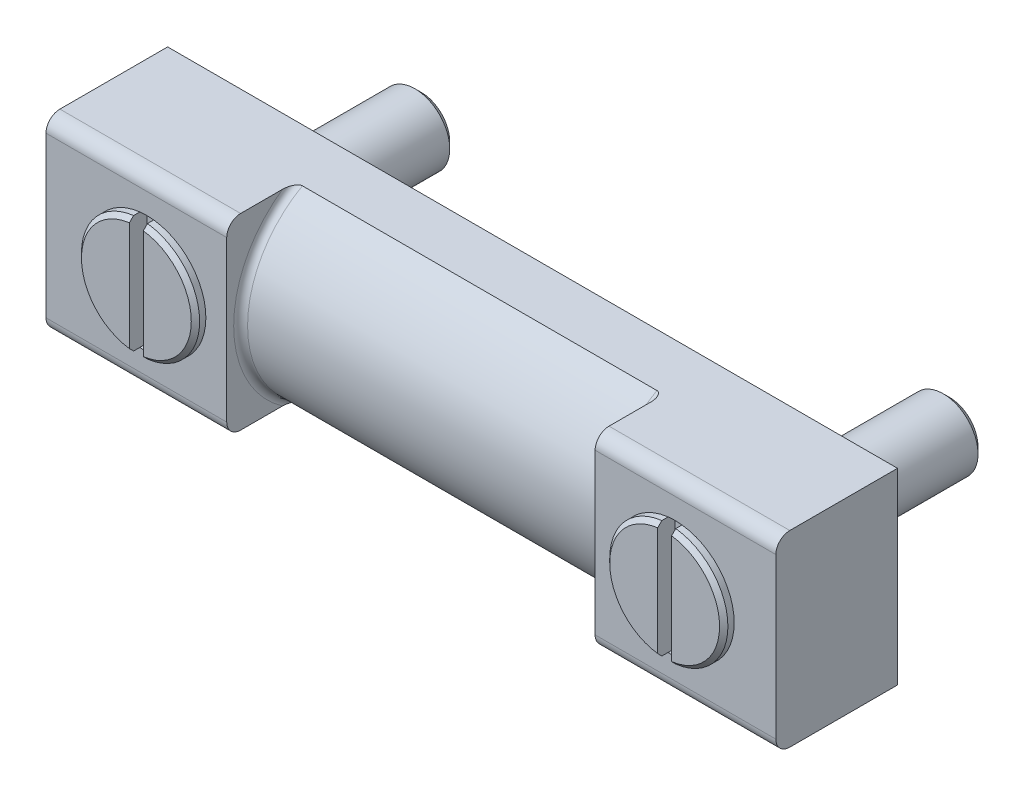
ISO-10303-21;
HEADER;
FILE_DESCRIPTION(('STEP AP214'),'2;1');
FILE_NAME('part.step','',(''),(''),'','','');
FILE_SCHEMA(('AUTOMOTIVE_DESIGN { 1 0 10303 214 1 1 1 1 }'));
ENDSEC;
DATA;
#1=APPLICATION_CONTEXT('core data for automotive mechanical design processes');
#2=APPLICATION_PROTOCOL_DEFINITION('international standard','automotive_design',2000,#1);
#3=PRODUCT_CONTEXT('',#1,'mechanical');
#4=PRODUCT('Part','Part','',(#3));
#5=PRODUCT_RELATED_PRODUCT_CATEGORY('part','',(#4));
#6=PRODUCT_DEFINITION_FORMATION('','',#4);
#7=PRODUCT_DEFINITION_CONTEXT('part definition',#1,'design');
#8=PRODUCT_DEFINITION('design','',#6,#7);
#9=PRODUCT_DEFINITION_SHAPE('','',#8);
#10=(LENGTH_UNIT() NAMED_UNIT(*) SI_UNIT(.MILLI.,.METRE.));
#11=(NAMED_UNIT(*) PLANE_ANGLE_UNIT() SI_UNIT($,.RADIAN.));
#12=(NAMED_UNIT(*) SI_UNIT($,.STERADIAN.) SOLID_ANGLE_UNIT());
#13=UNCERTAINTY_MEASURE_WITH_UNIT(LENGTH_MEASURE(1.E-05),#10,'distance_accuracy_value','');
#14=(GEOMETRIC_REPRESENTATION_CONTEXT(3) GLOBAL_UNCERTAINTY_ASSIGNED_CONTEXT((#13)) GLOBAL_UNIT_ASSIGNED_CONTEXT((#10,
#11,#12)) REPRESENTATION_CONTEXT('',''));
#15=CARTESIAN_POINT('',(0.,0.,0.));
#16=DIRECTION('',(0.,0.,1.));
#17=DIRECTION('',(1.,0.,0.));
#18=AXIS2_PLACEMENT_3D('',#15,#16,#17);
#19=CARTESIAN_POINT('',(5.13478148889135E-13,0.,19.));
#20=DIRECTION('',(0.,0.,-1.));
#21=DIRECTION('',(0.,-1.,0.));
#22=AXIS2_PLACEMENT_3D('',#19,#20,#21);
#23=PLANE('',#22);
#24=DIRECTION('',(0.,1.,0.));
#25=VECTOR('',#24,1.);
#26=CARTESIAN_POINT('',(1.00000000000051,0.,19.));
#27=LINE('',#26,#25);
#28=CARTESIAN_POINT('',(1.00000000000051,-7.83645327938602,19.));
#29=VERTEX_POINT('',#28);
#30=CARTESIAN_POINT('',(1.00000000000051,7.83645327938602,19.));
#31=VERTEX_POINT('',#30);
#32=EDGE_CURVE('E515',#29,#31,#27,.T.);
#33=ORIENTED_EDGE('',*,*,#32,.F.);
#34=CARTESIAN_POINT('',(5.13478148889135E-13,0.,19.));
#35=DIRECTION('',(0.,0.,-1.));
#36=DIRECTION('',(0.,-1.,0.));
#37=AXIS2_PLACEMENT_3D('',#34,#35,#36);
#38=CIRCLE('',#37,7.9);
#39=EDGE_CURVE('E502',#31,#29,#38,.T.);
#40=ORIENTED_EDGE('',*,*,#39,.F.);
#41=EDGE_LOOP('',(#33,#40));
#42=FACE_BOUND('',#41,.T.);
#43=ADVANCED_FACE('F14',(#42),#23,.F.);
#44=CARTESIAN_POINT('',(5.13478148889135E-13,0.,19.));
#45=DIRECTION('',(0.,0.,-1.));
#46=DIRECTION('',(0.,-1.,0.));
#47=AXIS2_PLACEMENT_3D('',#44,#45,#46);
#48=CONICAL_SURFACE('',#47,7.9,0.785398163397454);
#49=CARTESIAN_POINT('',(1.00000000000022,-18.679803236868,8.19344903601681));
#50=CARTESIAN_POINT('',(1.00000000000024,-18.0426173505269,8.82971690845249));
#51=CARTESIAN_POINT('',(1.00000000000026,-17.4053914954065,9.46594477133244));
#52=CARTESIAN_POINT('',(1.00000000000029,-16.130803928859,10.7382756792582));
#53=CARTESIAN_POINT('',(1.00000000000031,-15.4934422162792,11.3743787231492));
#54=CARTESIAN_POINT('',(1.00000000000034,-14.218410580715,12.6465313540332));
#55=CARTESIAN_POINT('',(1.00000000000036,-13.5807406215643,13.2825809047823));
#56=CARTESIAN_POINT('',(1.00000000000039,-12.3051318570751,14.5543993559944));
#57=CARTESIAN_POINT('',(1.00000000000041,-11.6671930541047,15.1901682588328));
#58=CARTESIAN_POINT('',(1.00000000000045,-10.3730178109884,16.4790638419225));
#59=CARTESIAN_POINT('',(1.00000000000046,-9.71676908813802,17.1321781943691));
#60=CARTESIAN_POINT('',(1.00000000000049,-8.73176436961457,18.1112320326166));
#61=CARTESIAN_POINT('',(1.0000000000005,-8.40331976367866,18.4374847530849));
#62=CARTESIAN_POINT('',(1.00000000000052,-7.74613392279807,19.0896896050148));
#63=CARTESIAN_POINT('',(1.00000000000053,-7.41739268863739,19.4156417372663));
#64=CARTESIAN_POINT('',(1.00000000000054,-6.75951889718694,20.0670672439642));
#65=CARTESIAN_POINT('',(1.00000000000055,-6.43038639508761,20.392540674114));
#66=CARTESIAN_POINT('',(1.00000000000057,-5.77144282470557,21.0428066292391));
#67=CARTESIAN_POINT('',(1.00000000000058,-5.44163174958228,21.3675991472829));
#68=CARTESIAN_POINT('',(1.0000000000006,-4.78091756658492,22.0160428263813));
#69=CARTESIAN_POINT('',(1.0000000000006,-4.45001451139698,22.3396940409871));
#70=CARTESIAN_POINT('',(1.00000000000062,-3.95208457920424,22.8235451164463));
#71=CARTESIAN_POINT('',(1.00000000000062,-3.78584672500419,22.9845565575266));
#72=CARTESIAN_POINT('',(1.00000000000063,-3.45259821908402,23.3057773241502));
#73=CARTESIAN_POINT('',(1.00000000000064,-3.2855875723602,23.4659866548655));
#74=CARTESIAN_POINT('',(1.00000000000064,-3.07275870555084,23.6686442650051));
#75=CARTESIAN_POINT('',(1.00000000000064,-3.02748694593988,23.7116664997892));
#76=CARTESIAN_POINT('',(1.00000000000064,-2.93684423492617,23.7976064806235));
#77=CARTESIAN_POINT('',(1.00000000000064,-2.89147328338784,23.8405242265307));
#78=CARTESIAN_POINT('',(1.00000000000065,-2.75519136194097,23.9691007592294));
#79=CARTESIAN_POINT('',(1.00000000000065,-2.66411247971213,24.054581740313));
#80=CARTESIAN_POINT('',(1.00000000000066,-2.48162249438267,24.224676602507));
#81=CARTESIAN_POINT('',(1.00000000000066,-2.39021303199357,24.3092922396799));
#82=CARTESIAN_POINT('',(1.00000000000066,-2.20660269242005,24.4776533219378));
#83=CARTESIAN_POINT('',(1.00000000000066,-2.1144018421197,24.561398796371));
#84=CARTESIAN_POINT('',(1.00000000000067,-1.89748677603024,24.7558539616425));
#85=CARTESIAN_POINT('',(1.00000000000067,-1.77234014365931,24.8660865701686));
#86=CARTESIAN_POINT('',(1.00000000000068,-1.58183895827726,25.0288658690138));
#87=CARTESIAN_POINT('',(1.00000000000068,-1.5177030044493,25.0828356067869));
#88=CARTESIAN_POINT('',(1.00000000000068,-1.38833234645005,25.1894113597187));
#89=CARTESIAN_POINT('',(1.00000000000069,-1.32309795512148,25.2420177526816));
#90=CARTESIAN_POINT('',(1.00000000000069,-1.19044796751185,25.3458314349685));
#91=CARTESIAN_POINT('',(1.00000000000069,-1.12301697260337,25.3970191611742));
#92=CARTESIAN_POINT('',(1.00000000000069,-0.985898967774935,25.4965179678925));
#93=CARTESIAN_POINT('',(1.00000000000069,-0.916209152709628,25.5448252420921));
#94=CARTESIAN_POINT('',(1.00000000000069,-0.774291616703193,25.6364359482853));
#95=CARTESIAN_POINT('',(1.00000000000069,-0.702085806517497,25.6797729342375));
#96=CARTESIAN_POINT('',(1.0000000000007,-0.553594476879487,25.7587163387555));
#97=CARTESIAN_POINT('',(1.0000000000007,-0.477321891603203,25.7943456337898));
#98=CARTESIAN_POINT('',(1.0000000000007,-0.3687525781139,25.8345348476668));
#99=CARTESIAN_POINT('',(1.0000000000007,-0.338523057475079,25.8446584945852));
#100=CARTESIAN_POINT('',(1.0000000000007,-0.277389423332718,25.8626522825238));
#101=CARTESIAN_POINT('',(1.0000000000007,-0.246485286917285,25.8705223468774));
#102=CARTESIAN_POINT('',(1.0000000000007,-0.184241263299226,25.8836220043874));
#103=CARTESIAN_POINT('',(1.0000000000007,-0.152903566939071,25.8888618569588));
#104=CARTESIAN_POINT('',(1.0000000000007,-0.0898818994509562,25.8964558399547));
#105=CARTESIAN_POINT('',(1.0000000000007,-0.0581980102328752,25.8988106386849));
#106=CARTESIAN_POINT('',(1.0000000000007,0.00544386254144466,25.9004937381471));
#107=CARTESIAN_POINT('',(1.0000000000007,0.0374023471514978,25.8998037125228));
#108=CARTESIAN_POINT('',(1.0000000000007,0.101104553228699,25.8954059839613));
#109=CARTESIAN_POINT('',(1.0000000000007,0.132848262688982,25.8916981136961));
#110=CARTESIAN_POINT('',(1.0000000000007,0.227564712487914,25.8763230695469));
#111=CARTESIAN_POINT('',(1.0000000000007,0.289862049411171,25.8604018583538));
#112=CARTESIAN_POINT('',(1.0000000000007,0.412365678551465,25.8198995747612));
#113=CARTESIAN_POINT('',(1.0000000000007,0.472529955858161,25.7951992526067));
#114=CARTESIAN_POINT('',(1.0000000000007,0.590187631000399,25.7399897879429));
#115=CARTESIAN_POINT('',(1.0000000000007,0.647676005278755,25.7094702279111));
#116=CARTESIAN_POINT('',(1.00000000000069,0.760829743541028,25.6443310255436));
#117=CARTESIAN_POINT('',(1.00000000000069,0.816477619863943,25.609681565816));
#118=CARTESIAN_POINT('',(1.00000000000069,0.89859804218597,25.5557315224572));
#119=CARTESIAN_POINT('',(1.00000000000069,0.925735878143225,25.5374264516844));
#120=CARTESIAN_POINT('',(1.00000000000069,0.979624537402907,25.500255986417));
#121=CARTESIAN_POINT('',(1.00000000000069,1.00637537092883,25.4813906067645));
#122=CARTESIAN_POINT('',(1.00000000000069,1.09079014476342,25.4207440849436));
#123=CARTESIAN_POINT('',(1.00000000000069,1.14782888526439,25.3780931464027));
#124=CARTESIAN_POINT('',(1.00000000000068,1.26071517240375,25.2912384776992));
#125=CARTESIAN_POINT('',(1.00000000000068,1.3165625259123,25.2470344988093));
#126=CARTESIAN_POINT('',(1.00000000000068,1.48280528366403,25.1127117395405));
#127=CARTESIAN_POINT('',(1.00000000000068,1.59184738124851,25.0209222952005));
#128=CARTESIAN_POINT('',(1.00000000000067,1.8079275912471,24.8346550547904));
#129=CARTESIAN_POINT('',(1.00000000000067,1.91496169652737,24.7401726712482));
#130=CARTESIAN_POINT('',(1.00000000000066,2.12755306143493,24.5496249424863));
#131=CARTESIAN_POINT('',(1.00000000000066,2.23311074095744,24.4535600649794));
#132=CARTESIAN_POINT('',(1.00000000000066,2.44293123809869,24.2606392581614));
#133=CARTESIAN_POINT('',(1.00000000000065,2.5471969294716,24.1637864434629));
#134=CARTESIAN_POINT('',(1.00000000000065,2.75503309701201,23.9693234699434));
#135=CARTESIAN_POINT('',(1.00000000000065,2.85860352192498,23.8717132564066));
#136=CARTESIAN_POINT('',(1.00000000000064,3.06511328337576,23.6760534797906));
#137=CARTESIAN_POINT('',(1.00000000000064,3.16805318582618,23.5780045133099));
#138=CARTESIAN_POINT('',(1.00000000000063,3.37353720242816,23.3814980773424));
#139=CARTESIAN_POINT('',(1.00000000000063,3.47608132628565,23.2830406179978));
#140=CARTESIAN_POINT('',(1.00000000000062,3.78230203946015,22.9881243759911));
#141=CARTESIAN_POINT('',(1.00000000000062,3.98553279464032,22.7912028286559));
#142=CARTESIAN_POINT('',(1.00000000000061,4.3912369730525,22.3965807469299));
#143=CARTESIAN_POINT('',(1.0000000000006,4.59371039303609,22.1988802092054));
#144=CARTESIAN_POINT('',(1.00000000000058,5.20038255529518,21.6049988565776));
#145=CARTESIAN_POINT('',(1.00000000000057,5.60382522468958,21.2080460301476));
#146=CARTESIAN_POINT('',(1.00000000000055,6.40985972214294,20.4129299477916));
#147=CARTESIAN_POINT('',(1.00000000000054,6.81245110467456,20.014766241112));
#148=CARTESIAN_POINT('',(1.00000000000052,7.61701514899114,19.217821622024));
#149=CARTESIAN_POINT('',(1.00000000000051,8.01898781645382,18.8190407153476));
#150=CARTESIAN_POINT('',(1.00000000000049,8.82250964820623,18.0211232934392));
#151=CARTESIAN_POINT('',(1.00000000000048,9.22405884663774,17.6219868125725));
#152=CARTESIAN_POINT('',(1.00000000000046,10.0268944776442,16.8234477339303));
#153=CARTESIAN_POINT('',(1.00000000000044,10.4281809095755,16.4240451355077));
#154=CARTESIAN_POINT('',(1.00000000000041,11.6316695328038,15.2256598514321));
#155=CARTESIAN_POINT('',(1.00000000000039,12.4335985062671,14.4264028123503));
#156=CARTESIAN_POINT('',(1.00000000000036,13.6892254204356,13.1743385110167));
#157=CARTESIAN_POINT('',(1.00000000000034,14.1430581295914,12.7216663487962));
#158=CARTESIAN_POINT('',(1.00000000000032,15.0506392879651,11.8162084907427));
#159=CARTESIAN_POINT('',(1.00000000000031,15.5043877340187,11.3634227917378));
#160=CARTESIAN_POINT('',(1.00000000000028,16.4117880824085,10.4577986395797));
#161=CARTESIAN_POINT('',(1.00000000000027,16.8654399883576,10.0049601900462));
#162=CARTESIAN_POINT('',(1.00000000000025,17.7726697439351,9.09923825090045));
#163=CARTESIAN_POINT('',(1.00000000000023,18.2262475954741,8.64635476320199));
#164=CARTESIAN_POINT('',(1.00000000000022,18.679803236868,8.19344903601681));
#165=B_SPLINE_CURVE_WITH_KNOTS('',3,(#49,#50,#51,#52,#53,#54,#55,#56,#57,#58,#59,#60,#61,#62,
#63,#64,#65,#66,#67,#68,#69,#70,#71,#72,#73,#74,#75,#76,#77,#78,#79,#80,#81,#82,#83,#84,#85,#86,
#87,#88,#89,#90,#91,#92,#93,#94,#95,#96,#97,#98,#99,#100,#101,#102,#103,#104,#105,#106,#107,
#108,#109,#110,#111,#112,#113,#114,#115,#116,#117,#118,#119,#120,#121,#122,#123,#124,#125,#126,
#127,#128,#129,#130,#131,#132,#133,#134,#135,#136,#137,#138,#139,#140,#141,#142,#143,#144,#145,
#146,#147,#148,#149,#150,#151,#152,#153,#154,#155,#156,#157,#158,#159,#160,#161,#162,#163,#164),
.UNSPECIFIED.,.F.,.F.,(4,2,2,2,2,2,2,2,2,2,2,2,2,2,2,2,2,2,2,2,2,2,2,2,2,2,2,2,2,2,2,2,2,2,2,2,
2,2,2,2,2,2,2,2,2,2,2,2,2,2,2,2,2,2,2,2,2,4),(0.,2.70140408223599,5.40283207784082,
8.10480130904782,10.8067472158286,13.5843332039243,14.9731636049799,16.3619903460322,
17.7506401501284,19.1393040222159,20.5279018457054,21.2221895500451,21.9164727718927,
22.1038332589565,22.2911940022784,22.6659202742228,23.0395988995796,23.4132648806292,
23.9135263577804,24.1649805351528,24.4163642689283,24.6702936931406,24.9245515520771,
25.1769769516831,25.4286425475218,25.5242105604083,25.6197818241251,25.714977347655,
25.8101508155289,25.9058978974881,26.0016502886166,26.1936298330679,26.3883235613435,
26.5833691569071,26.7799196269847,26.8781176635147,26.9763131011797,27.1899349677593,
27.4035912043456,27.8311053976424,28.2593974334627,28.6875650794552,29.1144870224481,
29.5414400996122,29.967926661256,30.3944026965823,31.2433555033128,32.0923119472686,
33.7902581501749,35.4889416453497,37.1876094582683,38.8861278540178,40.5846503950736,
43.981283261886,45.9042720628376,47.8273224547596,49.7502796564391,51.6731750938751),.UNSPECIFIED.);
#166=CARTESIAN_POINT('',(1.0000000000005,-8.44097150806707,18.4));
#167=VERTEX_POINT('',#166);
#168=EDGE_CURVE('E517',#167,#29,#165,.T.);
#169=ORIENTED_EDGE('',*,*,#168,.F.);
#170=CARTESIAN_POINT('',(4.9960036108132E-13,0.,18.4));
#171=DIRECTION('',(0.,0.,-1.));
#172=DIRECTION('',(0.,-1.,0.));
#173=AXIS2_PLACEMENT_3D('',#170,#171,#172);
#174=CIRCLE('',#173,8.5);
#175=CARTESIAN_POINT('',(1.0000000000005,8.44097150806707,18.4));
#176=VERTEX_POINT('',#175);
#177=EDGE_CURVE('E545',#176,#167,#174,.T.);
#178=ORIENTED_EDGE('',*,*,#177,.F.);
#179=EDGE_CURVE('E512',#31,#176,#165,.T.);
#180=ORIENTED_EDGE('',*,*,#179,.F.);
#181=ORIENTED_EDGE('',*,*,#39,.T.);
#182=EDGE_LOOP('',(#169,#178,#180,#181));
#183=FACE_BOUND('',#182,.T.);
#184=ADVANCED_FACE('F466',(#183),#48,.T.);
#185=CARTESIAN_POINT('',(-0.999999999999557,10.,16.5));
#186=DIRECTION('',(0.,0.,1.));
#187=DIRECTION('',(0.,1.,0.));
#188=AXIS2_PLACEMENT_3D('',#185,#186,#187);
#189=PLANE('',#188);
#190=CARTESIAN_POINT('',(4.44089209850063E-13,0.,16.5));
#191=DIRECTION('',(0.,0.,1.));
#192=DIRECTION('',(0.,1.,0.));
#193=AXIS2_PLACEMENT_3D('',#190,#191,#192);
#194=CIRCLE('',#193,8.5);
#195=CARTESIAN_POINT('',(-0.999999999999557,-8.44097150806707,16.5));
#196=VERTEX_POINT('',#195);
#197=CARTESIAN_POINT('',(1.00000000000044,-8.44097150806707,16.5));
#198=VERTEX_POINT('',#197);
#199=EDGE_CURVE('E550',#196,#198,#194,.T.);
#200=ORIENTED_EDGE('',*,*,#199,.T.);
#201=DIRECTION('',(0.,-1.,0.));
#202=VECTOR('',#201,1.);
#203=CARTESIAN_POINT('',(1.00000000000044,10.,16.5));
#204=LINE('',#203,#202);
#205=CARTESIAN_POINT('',(1.00000000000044,8.44097150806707,16.5));
#206=VERTEX_POINT('',#205);
#207=EDGE_CURVE('E396',#206,#198,#204,.T.);
#208=ORIENTED_EDGE('',*,*,#207,.F.);
#209=CARTESIAN_POINT('',(-0.999999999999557,8.44097150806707,16.5));
#210=VERTEX_POINT('',#209);
#211=EDGE_CURVE('E554',#206,#210,#194,.T.);
#212=ORIENTED_EDGE('',*,*,#211,.T.);
#213=DIRECTION('',(0.,-1.,0.));
#214=VECTOR('',#213,1.);
#215=CARTESIAN_POINT('',(-0.999999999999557,10.,16.5));
#216=LINE('',#215,#214);
#217=EDGE_CURVE('E947',#210,#196,#216,.T.);
#218=ORIENTED_EDGE('',*,*,#217,.T.);
#219=EDGE_LOOP('',(#200,#208,#212,#218));
#220=FACE_BOUND('',#219,.T.);
#221=ADVANCED_FACE('F472',(#220),#189,.T.);
#222=CARTESIAN_POINT('',(-5.96744875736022E-13,0.,-22.));
#223=DIRECTION('',(0.,0.,-1.));
#224=DIRECTION('',(0.,-1.,0.));
#225=AXIS2_PLACEMENT_3D('',#222,#223,#224);
#226=CYLINDRICAL_SURFACE('',#225,8.5);
#227=CARTESIAN_POINT('',(4.71844785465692E-13,0.,17.5));
#228=DIRECTION('',(0.,0.,-1.));
#229=DIRECTION('',(0.,-1.,0.));
#230=AXIS2_PLACEMENT_3D('',#227,#228,#229);
#231=CIRCLE('',#230,8.5);
#232=CARTESIAN_POINT('',(1.00000000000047,8.44097150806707,17.5));
#233=VERTEX_POINT('',#232);
#234=CARTESIAN_POINT('',(1.00000000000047,-8.44097150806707,17.5));
#235=VERTEX_POINT('',#234);
#236=EDGE_CURVE('E24',#233,#235,#231,.T.);
#237=ORIENTED_EDGE('',*,*,#236,.F.);
#238=DIRECTION('',(0.,0.,-1.));
#239=VECTOR('',#238,1.);
#240=CARTESIAN_POINT('',(0.999999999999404,8.44097150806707,-22.));
#241=LINE('',#240,#239);
#242=EDGE_CURVE('E559',#176,#233,#241,.T.);
#243=ORIENTED_EDGE('',*,*,#242,.F.);
#244=ORIENTED_EDGE('',*,*,#177,.T.);
#245=DIRECTION('',(0.,0.,-1.));
#246=VECTOR('',#245,1.);
#247=CARTESIAN_POINT('',(0.999999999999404,-8.44097150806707,-22.));
#248=LINE('',#247,#246);
#249=EDGE_CURVE('E501',#235,#167,#248,.F.);
#250=ORIENTED_EDGE('',*,*,#249,.F.);
#251=EDGE_LOOP('',(#237,#243,#244,#250));
#252=FACE_BOUND('',#251,.T.);
#253=ADVANCED_FACE('F487',(#252),#226,.T.);
#254=CARTESIAN_POINT('',(1.,0.,0.));
#255=DIRECTION('',(-1.,0.,0.));
#256=DIRECTION('',(0.,0.,1.));
#257=AXIS2_PLACEMENT_3D('',#254,#255,#256);
#258=PLANE('',#257);
#259=ORIENTED_EDGE('',*,*,#242,.T.);
#260=EDGE_CURVE('E558',#233,#206,#241,.T.);
#261=ORIENTED_EDGE('',*,*,#260,.T.);
#262=ORIENTED_EDGE('',*,*,#207,.T.);
#263=EDGE_CURVE('E547',#198,#235,#248,.F.);
#264=ORIENTED_EDGE('',*,*,#263,.T.);
#265=ORIENTED_EDGE('',*,*,#249,.T.);
#266=ORIENTED_EDGE('',*,*,#168,.T.);
#267=ORIENTED_EDGE('',*,*,#32,.T.);
#268=ORIENTED_EDGE('',*,*,#179,.T.);
#269=EDGE_LOOP('',(#259,#261,#262,#264,#265,#266,#267,#268));
#270=FACE_BOUND('',#269,.T.);
#271=ADVANCED_FACE('F484',(#270),#258,.T.);
#272=CARTESIAN_POINT('',(-0.999999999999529,-8.44097150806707,17.5));
#273=VERTEX_POINT('',#272);
#274=CARTESIAN_POINT('',(-0.999999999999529,8.44097150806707,17.5));
#275=VERTEX_POINT('',#274);
#276=EDGE_CURVE('E9',#273,#275,#231,.T.);
#277=ORIENTED_EDGE('',*,*,#276,.F.);
#278=DIRECTION('',(0.,0.,-1.));
#279=VECTOR('',#278,1.);
#280=CARTESIAN_POINT('',(-1.0000000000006,-8.44097150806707,-22.));
#281=LINE('',#280,#279);
#282=CARTESIAN_POINT('',(-0.999999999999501,-8.44097150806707,18.4));
#283=VERTEX_POINT('',#282);
#284=EDGE_CURVE('E553',#273,#283,#281,.F.);
#285=ORIENTED_EDGE('',*,*,#284,.T.);
#286=CARTESIAN_POINT('',(-0.999999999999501,8.44097150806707,18.4));
#287=VERTEX_POINT('',#286);
#288=EDGE_CURVE('E511',#283,#287,#174,.T.);
#289=ORIENTED_EDGE('',*,*,#288,.T.);
#290=DIRECTION('',(0.,0.,-1.));
#291=VECTOR('',#290,1.);
#292=CARTESIAN_POINT('',(-1.0000000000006,8.44097150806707,-22.));
#293=LINE('',#292,#291);
#294=EDGE_CURVE('E562',#287,#275,#293,.T.);
#295=ORIENTED_EDGE('',*,*,#294,.T.);
#296=EDGE_LOOP('',(#277,#285,#289,#295));
#297=FACE_BOUND('',#296,.T.);
#298=ADVANCED_FACE('F476',(#297),#226,.T.);
#299=CARTESIAN_POINT('',(-0.999999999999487,-7.83645327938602,19.));
#300=VERTEX_POINT('',#299);
#301=CARTESIAN_POINT('',(-0.999999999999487,7.83645327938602,19.));
#302=VERTEX_POINT('',#301);
#303=EDGE_CURVE('E492',#300,#302,#38,.T.);
#304=ORIENTED_EDGE('',*,*,#303,.F.);
#305=DIRECTION('',(0.,1.,0.));
#306=VECTOR('',#305,1.);
#307=CARTESIAN_POINT('',(-0.999999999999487,0.,19.));
#308=LINE('',#307,#306);
#309=EDGE_CURVE('E495',#300,#302,#308,.T.);
#310=ORIENTED_EDGE('',*,*,#309,.T.);
#311=EDGE_LOOP('',(#304,#310));
#312=FACE_BOUND('',#311,.T.);
#313=ADVANCED_FACE('F324',(#312),#23,.F.);
#314=ORIENTED_EDGE('',*,*,#303,.T.);
#315=CARTESIAN_POINT('',(-0.999999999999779,-18.679803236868,8.19344903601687));
#316=CARTESIAN_POINT('',(-0.999999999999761,-18.0426173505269,8.82971690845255));
#317=CARTESIAN_POINT('',(-0.999999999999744,-17.4053914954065,9.46594477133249));
#318=CARTESIAN_POINT('',(-0.999999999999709,-16.130803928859,10.7382756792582));
#319=CARTESIAN_POINT('',(-0.999999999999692,-15.4934422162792,11.3743787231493));
#320=CARTESIAN_POINT('',(-0.999999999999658,-14.218410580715,12.6465313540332));
#321=CARTESIAN_POINT('',(-0.999999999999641,-13.5807406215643,13.2825809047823));
#322=CARTESIAN_POINT('',(-0.999999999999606,-12.3051318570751,14.5543993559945));
#323=CARTESIAN_POINT('',(-0.999999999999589,-11.6671930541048,15.1901682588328));
#324=CARTESIAN_POINT('',(-0.999999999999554,-10.3730178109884,16.4790638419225));
#325=CARTESIAN_POINT('',(-0.999999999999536,-9.71676908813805,17.1321781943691));
#326=CARTESIAN_POINT('',(-0.99999999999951,-8.7317643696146,18.1112320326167));
#327=CARTESIAN_POINT('',(-0.999999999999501,-8.40331976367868,18.4374847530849));
#328=CARTESIAN_POINT('',(-0.999999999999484,-7.74613392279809,19.0896896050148));
#329=CARTESIAN_POINT('',(-0.999999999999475,-7.41739268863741,19.4156417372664));
#330=CARTESIAN_POINT('',(-0.999999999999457,-6.75951889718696,20.0670672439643));
#331=CARTESIAN_POINT('',(-0.999999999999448,-6.43038639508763,20.3925406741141));
#332=CARTESIAN_POINT('',(-0.999999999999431,-5.77144282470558,21.0428066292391));
#333=CARTESIAN_POINT('',(-0.999999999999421,-5.44163174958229,21.3675991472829));
#334=CARTESIAN_POINT('',(-0.999999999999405,-4.78091756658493,22.0160428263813));
#335=CARTESIAN_POINT('',(-0.999999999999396,-4.45001451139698,22.3396940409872));
#336=CARTESIAN_POINT('',(-0.999999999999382,-3.95208457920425,22.8235451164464));
#337=CARTESIAN_POINT('',(-0.999999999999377,-3.7858467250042,22.9845565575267));
#338=CARTESIAN_POINT('',(-0.999999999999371,-3.45259821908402,23.3057773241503));
#339=CARTESIAN_POINT('',(-0.99999999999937,-3.2855875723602,23.4659866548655));
#340=CARTESIAN_POINT('',(-0.999999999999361,-3.07275870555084,23.6686442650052));
#341=CARTESIAN_POINT('',(-0.999999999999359,-3.02748694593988,23.7116664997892));
#342=CARTESIAN_POINT('',(-0.999999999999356,-2.93684423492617,23.7976064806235));
#343=CARTESIAN_POINT('',(-0.999999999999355,-2.89147328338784,23.8405242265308));
#344=CARTESIAN_POINT('',(-0.999999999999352,-2.75519136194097,23.9691007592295));
#345=CARTESIAN_POINT('',(-0.99999999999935,-2.66411247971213,24.0545817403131));
#346=CARTESIAN_POINT('',(-0.999999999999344,-2.48162249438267,24.224676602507));
#347=CARTESIAN_POINT('',(-0.999999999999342,-2.39021303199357,24.3092922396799));
#348=CARTESIAN_POINT('',(-0.999999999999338,-2.20660269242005,24.4776533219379));
#349=CARTESIAN_POINT('',(-0.999999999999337,-2.1144018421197,24.561398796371));
#350=CARTESIAN_POINT('',(-0.999999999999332,-1.89748677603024,24.7558539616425));
#351=CARTESIAN_POINT('',(-0.999999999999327,-1.77234014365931,24.8660865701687));
#352=CARTESIAN_POINT('',(-0.999999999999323,-1.58183895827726,25.0288658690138));
#353=CARTESIAN_POINT('',(-0.999999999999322,-1.5177030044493,25.082835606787));
#354=CARTESIAN_POINT('',(-0.999999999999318,-1.38833234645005,25.1894113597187));
#355=CARTESIAN_POINT('',(-0.999999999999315,-1.32309795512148,25.2420177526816));
#356=CARTESIAN_POINT('',(-0.999999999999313,-1.19044796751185,25.3458314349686));
#357=CARTESIAN_POINT('',(-0.999999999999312,-1.12301697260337,25.3970191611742));
#358=CARTESIAN_POINT('',(-0.999999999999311,-0.985898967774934,25.4965179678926));
#359=CARTESIAN_POINT('',(-0.999999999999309,-0.916209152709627,25.5448252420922));
#360=CARTESIAN_POINT('',(-0.999999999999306,-0.774291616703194,25.6364359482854));
#361=CARTESIAN_POINT('',(-0.999999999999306,-0.7020858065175,25.6797729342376));
#362=CARTESIAN_POINT('',(-0.999999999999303,-0.553594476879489,25.7587163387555));
#363=CARTESIAN_POINT('',(-0.9999999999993,-0.477321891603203,25.7943456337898));
#364=CARTESIAN_POINT('',(-0.9999999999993,-0.3687525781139,25.8345348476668));
#365=CARTESIAN_POINT('',(-0.9999999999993,-0.33852305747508,25.8446584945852));
#366=CARTESIAN_POINT('',(-0.9999999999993,-0.277389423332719,25.8626522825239));
#367=CARTESIAN_POINT('',(-0.9999999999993,-0.246485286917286,25.8705223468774));
#368=CARTESIAN_POINT('',(-0.9999999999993,-0.184241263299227,25.8836220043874));
#369=CARTESIAN_POINT('',(-0.999999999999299,-0.152903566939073,25.8888618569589));
#370=CARTESIAN_POINT('',(-0.9999999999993,-0.089881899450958,25.8964558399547));
#371=CARTESIAN_POINT('',(-0.9999999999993,-0.058198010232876,25.8988106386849));
#372=CARTESIAN_POINT('',(-0.9999999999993,0.00544386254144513,25.9004937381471));
#373=CARTESIAN_POINT('',(-0.999999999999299,0.0374023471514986,25.8998037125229));
#374=CARTESIAN_POINT('',(-0.999999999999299,0.1011045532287,25.8954059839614));
#375=CARTESIAN_POINT('',(-0.999999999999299,0.132848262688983,25.8916981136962));
#376=CARTESIAN_POINT('',(-0.9999999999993,0.227564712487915,25.876323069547));
#377=CARTESIAN_POINT('',(-0.9999999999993,0.289862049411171,25.8604018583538));
#378=CARTESIAN_POINT('',(-0.9999999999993,0.412365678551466,25.8198995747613));
#379=CARTESIAN_POINT('',(-0.999999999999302,0.472529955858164,25.7951992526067));
#380=CARTESIAN_POINT('',(-0.999999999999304,0.590187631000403,25.739989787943));
#381=CARTESIAN_POINT('',(-0.999999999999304,0.647676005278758,25.7094702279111));
#382=CARTESIAN_POINT('',(-0.999999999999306,0.76082974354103,25.6443310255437));
#383=CARTESIAN_POINT('',(-0.999999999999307,0.816477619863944,25.609681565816));
#384=CARTESIAN_POINT('',(-0.999999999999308,0.898598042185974,25.5557315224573));
#385=CARTESIAN_POINT('',(-0.999999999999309,0.92573587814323,25.5374264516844));
#386=CARTESIAN_POINT('',(-0.999999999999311,0.979624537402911,25.500255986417));
#387=CARTESIAN_POINT('',(-0.999999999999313,1.00637537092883,25.4813906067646));
#388=CARTESIAN_POINT('',(-0.999999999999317,1.09079014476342,25.4207440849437));
#389=CARTESIAN_POINT('',(-0.999999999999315,1.14782888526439,25.3780931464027));
#390=CARTESIAN_POINT('',(-0.999999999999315,1.26071517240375,25.2912384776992));
#391=CARTESIAN_POINT('',(-0.999999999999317,1.31656252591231,25.2470344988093));
#392=CARTESIAN_POINT('',(-0.999999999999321,1.48280528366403,25.1127117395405));
#393=CARTESIAN_POINT('',(-0.999999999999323,1.59184738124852,25.0209222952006));
#394=CARTESIAN_POINT('',(-0.999999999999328,1.80792759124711,24.8346550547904));
#395=CARTESIAN_POINT('',(-0.999999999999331,1.91496169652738,24.7401726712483));
#396=CARTESIAN_POINT('',(-0.999999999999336,2.12755306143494,24.5496249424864));
#397=CARTESIAN_POINT('',(-0.999999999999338,2.23311074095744,24.4535600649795));
#398=CARTESIAN_POINT('',(-0.999999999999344,2.44293123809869,24.2606392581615));
#399=CARTESIAN_POINT('',(-0.999999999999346,2.5471969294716,24.163786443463));
#400=CARTESIAN_POINT('',(-0.999999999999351,2.75503309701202,23.9693234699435));
#401=CARTESIAN_POINT('',(-0.999999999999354,2.85860352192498,23.8717132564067));
#402=CARTESIAN_POINT('',(-0.999999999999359,3.06511328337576,23.6760534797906));
#403=CARTESIAN_POINT('',(-0.999999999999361,3.16805318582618,23.57800451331));
#404=CARTESIAN_POINT('',(-0.999999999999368,3.37353720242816,23.3814980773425));
#405=CARTESIAN_POINT('',(-0.999999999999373,3.47608132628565,23.2830406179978));
#406=CARTESIAN_POINT('',(-0.999999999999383,3.78230203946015,22.9881243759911));
#407=CARTESIAN_POINT('',(-0.999999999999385,3.98553279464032,22.7912028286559));
#408=CARTESIAN_POINT('',(-0.999999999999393,4.39123697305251,22.39658074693));
#409=CARTESIAN_POINT('',(-0.999999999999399,4.59371039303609,22.1988802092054));
#410=CARTESIAN_POINT('',(-0.999999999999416,5.20038255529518,21.6049988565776));
#411=CARTESIAN_POINT('',(-0.999999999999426,5.60382522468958,21.2080460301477));
#412=CARTESIAN_POINT('',(-0.999999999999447,6.40985972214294,20.4129299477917));
#413=CARTESIAN_POINT('',(-0.999999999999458,6.81245110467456,20.0147662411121));
#414=CARTESIAN_POINT('',(-0.99999999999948,7.61701514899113,19.2178216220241));
#415=CARTESIAN_POINT('',(-0.999999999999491,8.01898781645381,18.8190407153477));
#416=CARTESIAN_POINT('',(-0.999999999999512,8.82250964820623,18.0211232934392));
#417=CARTESIAN_POINT('',(-0.999999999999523,9.22405884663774,17.6219868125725));
#418=CARTESIAN_POINT('',(-0.999999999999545,10.0268944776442,16.8234477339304));
#419=CARTESIAN_POINT('',(-0.999999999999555,10.4281809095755,16.4240451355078));
#420=CARTESIAN_POINT('',(-0.999999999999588,11.6316695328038,15.2256598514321));
#421=CARTESIAN_POINT('',(-0.999999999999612,12.4335985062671,14.4264028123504));
#422=CARTESIAN_POINT('',(-0.999999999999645,13.6892254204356,13.1743385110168));
#423=CARTESIAN_POINT('',(-0.999999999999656,14.1430581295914,12.7216663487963));
#424=CARTESIAN_POINT('',(-0.99999999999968,15.0506392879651,11.8162084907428));
#425=CARTESIAN_POINT('',(-0.999999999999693,15.5043877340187,11.3634227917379));
#426=CARTESIAN_POINT('',(-0.999999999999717,16.4117880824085,10.4577986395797));
#427=CARTESIAN_POINT('',(-0.999999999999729,16.8654399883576,10.0049601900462));
#428=CARTESIAN_POINT('',(-0.999999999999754,17.7726697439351,9.0992382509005));
#429=CARTESIAN_POINT('',(-0.999999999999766,18.2262475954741,8.64635476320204));
#430=CARTESIAN_POINT('',(-0.999999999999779,18.679803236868,8.19344903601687));
#431=B_SPLINE_CURVE_WITH_KNOTS('',3,(#315,#316,#317,#318,#319,#320,#321,#322,#323,#324,#325,
#326,#327,#328,#329,#330,#331,#332,#333,#334,#335,#336,#337,#338,#339,#340,#341,#342,#343,#344,
#345,#346,#347,#348,#349,#350,#351,#352,#353,#354,#355,#356,#357,#358,#359,#360,#361,#362,#363,
#364,#365,#366,#367,#368,#369,#370,#371,#372,#373,#374,#375,#376,#377,#378,#379,#380,#381,#382,
#383,#384,#385,#386,#387,#388,#389,#390,#391,#392,#393,#394,#395,#396,#397,#398,#399,#400,#401,
#402,#403,#404,#405,#406,#407,#408,#409,#410,#411,#412,#413,#414,#415,#416,#417,#418,#419,#420,
#421,#422,#423,#424,#425,#426,#427,#428,#429,#430),.UNSPECIFIED.,.F.,.F.,(4,2,2,2,2,2,2,2,2,2,2,
2,2,2,2,2,2,2,2,2,2,2,2,2,2,2,2,2,2,2,2,2,2,2,2,2,2,2,2,2,2,2,2,2,2,2,2,2,2,2,2,2,2,2,2,2,2,4),
(0.,2.70140408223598,5.40283207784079,8.10480130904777,10.8067472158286,13.5843332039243,
14.9731636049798,16.3619903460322,17.7506401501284,19.1393040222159,20.5279018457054,
21.222189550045,21.9164727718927,22.1038332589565,22.2911940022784,22.6659202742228,
23.0395988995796,23.4132648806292,23.9135263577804,24.1649805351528,24.4163642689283,
24.6702936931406,24.9245515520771,25.1769769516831,25.4286425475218,25.5242105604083,
25.619781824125,25.714977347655,25.8101508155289,25.9058978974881,26.0016502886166,
26.1936298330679,26.3883235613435,26.5833691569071,26.7799196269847,26.8781176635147,
26.9763131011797,27.1899349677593,27.4035912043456,27.8311053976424,28.2593974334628,
28.6875650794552,29.1144870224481,29.5414400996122,29.967926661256,30.3944026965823,
31.2433555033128,32.0923119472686,33.790258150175,35.4889416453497,37.1876094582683,
38.8861278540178,40.5846503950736,43.981283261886,45.9042720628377,47.8273224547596,
49.7502796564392,51.6731750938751),.UNSPECIFIED.);
#432=EDGE_CURVE('E507',#302,#287,#431,.T.);
#433=ORIENTED_EDGE('',*,*,#432,.T.);
#434=ORIENTED_EDGE('',*,*,#288,.F.);
#435=EDGE_CURVE('E506',#283,#300,#431,.T.);
#436=ORIENTED_EDGE('',*,*,#435,.T.);
#437=EDGE_LOOP('',(#314,#433,#434,#436));
#438=FACE_BOUND('',#437,.T.);
#439=ADVANCED_FACE('F463',(#438),#48,.T.);
#440=CARTESIAN_POINT('',(-1.,0.,0.));
#441=DIRECTION('',(-1.,0.,0.));
#442=DIRECTION('',(0.,0.,1.));
#443=AXIS2_PLACEMENT_3D('',#440,#441,#442);
#444=PLANE('',#443);
#445=ORIENTED_EDGE('',*,*,#432,.F.);
#446=ORIENTED_EDGE('',*,*,#309,.F.);
#447=ORIENTED_EDGE('',*,*,#435,.F.);
#448=ORIENTED_EDGE('',*,*,#284,.F.);
#449=EDGE_CURVE('E555',#196,#273,#281,.F.);
#450=ORIENTED_EDGE('',*,*,#449,.F.);
#451=ORIENTED_EDGE('',*,*,#217,.F.);
#452=EDGE_CURVE('E33',#275,#210,#293,.T.);
#453=ORIENTED_EDGE('',*,*,#452,.F.);
#454=ORIENTED_EDGE('',*,*,#294,.F.);
#455=EDGE_LOOP('',(#445,#446,#447,#448,#450,#451,#453,#454));
#456=FACE_BOUND('',#455,.T.);
#457=ADVANCED_FACE('F449',(#456),#444,.F.);
#458=CARTESIAN_POINT('',(0.,0.,0.));
#459=DIRECTION('',(0.,0.,-1.));
#460=DIRECTION('',(0.,-1.,0.));
#461=AXIS2_PLACEMENT_3D('',#458,#459,#460);
#462=CONICAL_SURFACE('',#461,4.08,0.78539816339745);
#463=CARTESIAN_POINT('',(0.,0.,-0.92));
#464=DIRECTION('',(0.,0.,-1.));
#465=DIRECTION('',(0.,-1.,0.));
#466=AXIS2_PLACEMENT_3D('',#463,#464,#465);
#467=CIRCLE('',#466,5.);
#468=CARTESIAN_POINT('',(0.,-5.,-0.92));
#469=VERTEX_POINT('',#468);
#470=EDGE_CURVE('E531',#469,#469,#467,.T.);
#471=ORIENTED_EDGE('',*,*,#470,.F.);
#472=EDGE_LOOP('',(#471));
#473=FACE_BOUND('',#472,.T.);
#474=CARTESIAN_POINT('',(0.,0.,0.));
#475=DIRECTION('',(0.,0.,-1.));
#476=DIRECTION('',(0.,-1.,0.));
#477=AXIS2_PLACEMENT_3D('',#474,#475,#476);
#478=CIRCLE('',#477,4.08);
#479=CARTESIAN_POINT('',(0.,-4.08,0.));
#480=VERTEX_POINT('',#479);
#481=EDGE_CURVE('E536',#480,#480,#478,.T.);
#482=ORIENTED_EDGE('',*,*,#481,.T.);
#483=EDGE_LOOP('',(#482));
#484=FACE_BOUND('',#483,.T.);
#485=ADVANCED_FACE('F462',(#473,#484),#462,.T.);
#486=CARTESIAN_POINT('',(-5.96744875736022E-13,0.,-22.));
#487=DIRECTION('',(0.,0.,-1.));
#488=DIRECTION('',(0.,-1.,0.));
#489=AXIS2_PLACEMENT_3D('',#486,#487,#488);
#490=CYLINDRICAL_SURFACE('',#489,4.08);
#491=ORIENTED_EDGE('',*,*,#481,.F.);
#492=EDGE_LOOP('',(#491));
#493=FACE_BOUND('',#492,.T.);
#494=CARTESIAN_POINT('',(0.,0.,3.));
#495=DIRECTION('',(0.,0.,-1.));
#496=DIRECTION('',(0.,-1.,0.));
#497=AXIS2_PLACEMENT_3D('',#494,#495,#496);
#498=CIRCLE('',#497,4.08);
#499=CARTESIAN_POINT('',(0.,-4.08,3.));
#500=VERTEX_POINT('',#499);
#501=EDGE_CURVE('E539',#500,#500,#498,.T.);
#502=ORIENTED_EDGE('',*,*,#501,.T.);
#503=EDGE_LOOP('',(#502));
#504=FACE_BOUND('',#503,.T.);
#505=ADVANCED_FACE('F867',(#493,#504),#490,.T.);
#506=CARTESIAN_POINT('',(-4.99999999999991,0.,3.00000000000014));
#507=DIRECTION('',(0.,0.,1.));
#508=DIRECTION('',(0.,1.,0.));
#509=AXIS2_PLACEMENT_3D('',#506,#507,#508);
#510=PLANE('',#509);
#511=ORIENTED_EDGE('',*,*,#501,.F.);
#512=EDGE_LOOP('',(#511));
#513=FACE_BOUND('',#512,.T.);
#514=CARTESIAN_POINT('',(0.,0.,3.));
#515=DIRECTION('',(0.,0.,-1.));
#516=DIRECTION('',(0.,-1.,0.));
#517=AXIS2_PLACEMENT_3D('',#514,#515,#516);
#518=CIRCLE('',#517,5.);
#519=CARTESIAN_POINT('',(0.,-5.,3.));
#520=VERTEX_POINT('',#519);
#521=EDGE_CURVE('E542',#520,#520,#518,.T.);
#522=ORIENTED_EDGE('',*,*,#521,.T.);
#523=EDGE_LOOP('',(#522));
#524=FACE_BOUND('',#523,.T.);
#525=ADVANCED_FACE('F840',(#513,#524),#510,.F.);
#526=CARTESIAN_POINT('',(76.,0.,18.999999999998));
#527=DIRECTION('',(0.,0.,-1.));
#528=DIRECTION('',(0.,-1.,0.));
#529=AXIS2_PLACEMENT_3D('',#526,#527,#528);
#530=PLANE('',#529);
#531=DIRECTION('',(0.,1.,0.));
#532=VECTOR('',#531,1.);
#533=CARTESIAN_POINT('',(77.,0.,18.9999999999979));
#534=LINE('',#533,#532);
#535=CARTESIAN_POINT('',(77.,-7.83645327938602,18.9999999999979));
#536=VERTEX_POINT('',#535);
#537=CARTESIAN_POINT('',(77.,7.83645327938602,18.9999999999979));
#538=VERTEX_POINT('',#537);
#539=EDGE_CURVE('E409',#536,#538,#534,.T.);
#540=ORIENTED_EDGE('',*,*,#539,.F.);
#541=CARTESIAN_POINT('',(76.,0.,18.999999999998));
#542=DIRECTION('',(0.,0.,-1.));
#543=DIRECTION('',(0.,-1.,0.));
#544=AXIS2_PLACEMENT_3D('',#541,#542,#543);
#545=CIRCLE('',#544,7.9);
#546=EDGE_CURVE('E201',#538,#536,#545,.T.);
#547=ORIENTED_EDGE('',*,*,#546,.F.);
#548=EDGE_LOOP('',(#540,#547));
#549=FACE_BOUND('',#548,.T.);
#550=ADVANCED_FACE('F460',(#549),#530,.F.);
#551=CARTESIAN_POINT('',(75.,-7.83645327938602,18.999999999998));
#552=VERTEX_POINT('',#551);
#553=CARTESIAN_POINT('',(75.,7.83645327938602,18.999999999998));
#554=VERTEX_POINT('',#553);
#555=EDGE_CURVE('E194',#552,#554,#545,.T.);
#556=ORIENTED_EDGE('',*,*,#555,.F.);
#557=DIRECTION('',(0.,1.,0.));
#558=VECTOR('',#557,1.);
#559=CARTESIAN_POINT('',(75.,0.,18.999999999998));
#560=LINE('',#559,#558);
#561=EDGE_CURVE('E169',#552,#554,#560,.T.);
#562=ORIENTED_EDGE('',*,*,#561,.T.);
#563=EDGE_LOOP('',(#556,#562));
#564=FACE_BOUND('',#563,.T.);
#565=ADVANCED_FACE('F16',(#564),#530,.F.);
#566=CARTESIAN_POINT('',(76.,0.,-2.06175871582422E-12));
#567=DIRECTION('',(0.,0.,-1.));
#568=DIRECTION('',(0.,-1.,0.));
#569=AXIS2_PLACEMENT_3D('',#566,#567,#568);
#570=CONICAL_SURFACE('',#569,4.08,0.78539816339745);
#571=CARTESIAN_POINT('',(76.,0.,-0.920000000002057));
#572=DIRECTION('',(0.,0.,-1.));
#573=DIRECTION('',(0.,-1.,0.));
#574=AXIS2_PLACEMENT_3D('',#571,#572,#573);
#575=CIRCLE('',#574,5.);
#576=CARTESIAN_POINT('',(76.,-5.,-0.920000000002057));
#577=VERTEX_POINT('',#576);
#578=EDGE_CURVE('E618',#577,#577,#575,.T.);
#579=ORIENTED_EDGE('',*,*,#578,.F.);
#580=EDGE_LOOP('',(#579));
#581=FACE_BOUND('',#580,.T.);
#582=CARTESIAN_POINT('',(76.,0.,-2.06175871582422E-12));
#583=DIRECTION('',(0.,0.,-1.));
#584=DIRECTION('',(0.,-1.,0.));
#585=AXIS2_PLACEMENT_3D('',#582,#583,#584);
#586=CIRCLE('',#585,4.08);
#587=CARTESIAN_POINT('',(76.,-4.08,-2.06175871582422E-12));
#588=VERTEX_POINT('',#587);
#589=EDGE_CURVE('E620',#588,#588,#586,.T.);
#590=ORIENTED_EDGE('',*,*,#589,.T.);
#591=EDGE_LOOP('',(#590));
#592=FACE_BOUND('',#591,.T.);
#593=ADVANCED_FACE('F435',(#581,#592),#570,.T.);
#594=CARTESIAN_POINT('',(76.,0.,18.999999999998));
#595=DIRECTION('',(0.,0.,-1.));
#596=DIRECTION('',(0.,-1.,0.));
#597=AXIS2_PLACEMENT_3D('',#594,#595,#596);
#598=CONICAL_SURFACE('',#597,7.9,0.785398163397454);
#599=CARTESIAN_POINT('',(77.,-18.679803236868,8.19344903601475));
#600=CARTESIAN_POINT('',(77.0000000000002,-18.0426173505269,8.82971690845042));
#601=CARTESIAN_POINT('',(77.0000000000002,-17.4053914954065,9.46594477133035));
#602=CARTESIAN_POINT('',(77.0000000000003,-16.130803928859,10.7382756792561));
#603=CARTESIAN_POINT('',(77.0000000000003,-15.4934422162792,11.3743787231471));
#604=CARTESIAN_POINT('',(77.0000000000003,-14.218410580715,12.6465313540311));
#605=CARTESIAN_POINT('',(77.0000000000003,-13.5807406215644,13.2825809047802));
#606=CARTESIAN_POINT('',(77.0000000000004,-12.3051318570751,14.5543993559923));
#607=CARTESIAN_POINT('',(77.0000000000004,-11.6671930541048,15.1901682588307));
#608=CARTESIAN_POINT('',(77.0000000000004,-10.3730178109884,16.4790638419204));
#609=CARTESIAN_POINT('',(77.0000000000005,-9.71676908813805,17.132178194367));
#610=CARTESIAN_POINT('',(77.0000000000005,-8.73176436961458,18.1112320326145));
#611=CARTESIAN_POINT('',(77.0000000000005,-8.40331976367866,18.4374847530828));
#612=CARTESIAN_POINT('',(77.0000000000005,-7.74613392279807,19.0896896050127));
#613=CARTESIAN_POINT('',(77.0000000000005,-7.41739268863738,19.4156417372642));
#614=CARTESIAN_POINT('',(77.0000000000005,-6.75951889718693,20.0670672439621));
#615=CARTESIAN_POINT('',(77.0000000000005,-6.4303863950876,20.3925406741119));
#616=CARTESIAN_POINT('',(77.0000000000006,-5.77144282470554,21.0428066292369));
#617=CARTESIAN_POINT('',(77.0000000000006,-5.44163174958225,21.3675991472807));
#618=CARTESIAN_POINT('',(77.0000000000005,-4.7809175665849,22.0160428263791));
#619=CARTESIAN_POINT('',(77.0000000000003,-4.45001451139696,22.339694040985));
#620=CARTESIAN_POINT('',(77.0000000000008,-3.95208457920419,22.8235451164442));
#621=CARTESIAN_POINT('',(77.000000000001,-3.78584672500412,22.9845565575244));
#622=CARTESIAN_POINT('',(77.0000000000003,-3.45259821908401,23.3057773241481));
#623=CARTESIAN_POINT('',(76.9999999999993,-3.28558757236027,23.4659866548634));
#624=CARTESIAN_POINT('',(77.0000000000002,-3.07275870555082,23.668644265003));
#625=CARTESIAN_POINT('',(77.0000000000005,-3.02748694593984,23.711666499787));
#626=CARTESIAN_POINT('',(77.0000000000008,-2.93684423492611,23.7976064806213));
#627=CARTESIAN_POINT('',(77.0000000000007,-2.89147328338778,23.8405242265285));
#628=CARTESIAN_POINT('',(77.0000000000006,-2.75519136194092,23.9691007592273));
#629=CARTESIAN_POINT('',(77.0000000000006,-2.66411247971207,24.0545817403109));
#630=CARTESIAN_POINT('',(77.0000000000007,-2.48162249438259,24.2246766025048));
#631=CARTESIAN_POINT('',(77.0000000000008,-2.39021303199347,24.3092922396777));
#632=CARTESIAN_POINT('',(77.0000000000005,-2.20660269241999,24.4776533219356));
#633=CARTESIAN_POINT('',(77.0000000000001,-2.11440184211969,24.5613987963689));
#634=CARTESIAN_POINT('',(76.9999999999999,-1.89748677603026,24.7558539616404));
#635=CARTESIAN_POINT('',(77.0000000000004,-1.77234014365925,24.8660865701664));
#636=CARTESIAN_POINT('',(77.0000000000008,-1.58183895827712,25.0288658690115));
#637=CARTESIAN_POINT('',(77.0000000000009,-1.51770300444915,25.0828356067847));
#638=CARTESIAN_POINT('',(77.0000000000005,-1.38833234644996,25.1894113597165));
#639=CARTESIAN_POINT('',(77.,-1.32309795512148,25.2420177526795));
#640=CARTESIAN_POINT('',(77.,-1.19044796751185,25.3458314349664));
#641=CARTESIAN_POINT('',(77.0000000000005,-1.12301697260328,25.3970191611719));
#642=CARTESIAN_POINT('',(77.0000000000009,-0.985898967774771,25.4965179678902));
#643=CARTESIAN_POINT('',(77.0000000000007,-0.916209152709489,25.5448252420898));
#644=CARTESIAN_POINT('',(77.0000000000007,-0.774291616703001,25.6364359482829));
#645=CARTESIAN_POINT('',(77.000000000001,-0.702085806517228,25.679772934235));
#646=CARTESIAN_POINT('',(77.0000000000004,-0.553594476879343,25.7587163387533));
#647=CARTESIAN_POINT('',(76.9999999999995,-0.477321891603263,25.794345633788));
#648=CARTESIAN_POINT('',(77.0000000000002,-0.368752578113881,25.8345348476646));
#649=CARTESIAN_POINT('',(77.0000000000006,-0.338523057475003,25.8446584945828));
#650=CARTESIAN_POINT('',(77.0000000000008,-0.277389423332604,25.8626522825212));
#651=CARTESIAN_POINT('',(77.0000000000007,-0.24648528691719,25.8705223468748));
#652=CARTESIAN_POINT('',(77.0000000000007,-0.184241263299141,25.8836220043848));
#653=CARTESIAN_POINT('',(77.0000000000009,-0.152903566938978,25.8888618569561));
#654=CARTESIAN_POINT('',(77.0000000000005,-0.0898818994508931,25.8964558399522));
#655=CARTESIAN_POINT('',(77.,-0.0581980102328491,25.8988106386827));
#656=CARTESIAN_POINT('',(77.,0.00544386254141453,25.900493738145));
#657=CARTESIAN_POINT('',(77.0000000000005,0.0374023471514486,25.8998037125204));
#658=CARTESIAN_POINT('',(77.0000000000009,0.101104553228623,25.8954059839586));
#659=CARTESIAN_POINT('',(77.0000000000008,0.132848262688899,25.8916981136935));
#660=CARTESIAN_POINT('',(77.0000000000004,0.22756471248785,25.8763230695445));
#661=CARTESIAN_POINT('',(77.,0.289862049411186,25.8604018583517));
#662=CARTESIAN_POINT('',(77.,0.412365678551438,25.8198995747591));
#663=CARTESIAN_POINT('',(77.0000000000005,0.472529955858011,25.7951992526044));
#664=CARTESIAN_POINT('',(77.0000000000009,0.590187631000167,25.7399897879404));
#665=CARTESIAN_POINT('',(77.0000000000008,0.647676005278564,25.7094702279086));
#666=CARTESIAN_POINT('',(77.0000000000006,0.760829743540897,25.6443310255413));
#667=CARTESIAN_POINT('',(77.0000000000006,0.81647761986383,25.6096815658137));
#668=CARTESIAN_POINT('',(77.0000000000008,0.898598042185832,25.5557315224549));
#669=CARTESIAN_POINT('',(77.0000000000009,0.925735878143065,25.537426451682));
#670=CARTESIAN_POINT('',(77.0000000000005,0.979624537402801,25.5002559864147));
#671=CARTESIAN_POINT('',(77.0000000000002,1.0063753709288,25.4813906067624));
#672=CARTESIAN_POINT('',(76.9999999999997,1.09079014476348,25.4207440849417));
#673=CARTESIAN_POINT('',(77.0000000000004,1.14782888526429,25.3780931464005));
#674=CARTESIAN_POINT('',(77.000000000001,1.26071517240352,25.2912384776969));
#675=CARTESIAN_POINT('',(77.0000000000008,1.31656252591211,25.247034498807));
#676=CARTESIAN_POINT('',(77.0000000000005,1.48280528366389,25.1127117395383));
#677=CARTESIAN_POINT('',(77.0000000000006,1.59184738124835,25.0209222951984));
#678=CARTESIAN_POINT('',(77.0000000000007,1.80792759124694,24.8346550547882));
#679=CARTESIAN_POINT('',(77.0000000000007,1.91496169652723,24.740172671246));
#680=CARTESIAN_POINT('',(77.0000000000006,2.12755306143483,24.5496249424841));
#681=CARTESIAN_POINT('',(77.0000000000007,2.23311074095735,24.4535600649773));
#682=CARTESIAN_POINT('',(77.0000000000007,2.44293123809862,24.2606392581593));
#683=CARTESIAN_POINT('',(77.0000000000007,2.54719692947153,24.1637864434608));
#684=CARTESIAN_POINT('',(77.0000000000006,2.75503309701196,23.9693234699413));
#685=CARTESIAN_POINT('',(77.0000000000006,2.85860352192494,23.8717132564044));
#686=CARTESIAN_POINT('',(77.0000000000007,3.06511328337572,23.6760534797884));
#687=CARTESIAN_POINT('',(77.0000000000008,3.16805318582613,23.5780045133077));
#688=CARTESIAN_POINT('',(77.0000000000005,3.37353720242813,23.3814980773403));
#689=CARTESIAN_POINT('',(77.0000000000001,3.47608132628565,23.2830406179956));
#690=CARTESIAN_POINT('',(76.9999999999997,3.78230203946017,22.988124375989));
#691=CARTESIAN_POINT('',(77.0000000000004,3.98553279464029,22.7912028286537));
#692=CARTESIAN_POINT('',(77.0000000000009,4.39123697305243,22.3965807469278));
#693=CARTESIAN_POINT('',(77.0000000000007,4.59371039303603,22.1988802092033));
#694=CARTESIAN_POINT('',(77.0000000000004,5.20038255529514,21.6049988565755));
#695=CARTESIAN_POINT('',(77.0000000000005,5.60382522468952,21.2080460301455));
#696=CARTESIAN_POINT('',(77.0000000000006,6.40985972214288,20.4129299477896));
#697=CARTESIAN_POINT('',(77.0000000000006,6.8124511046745,20.01476624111));
#698=CARTESIAN_POINT('',(77.0000000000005,7.6170151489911,19.217821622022));
#699=CARTESIAN_POINT('',(77.0000000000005,8.01898781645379,18.8190407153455));
#700=CARTESIAN_POINT('',(77.0000000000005,8.82250964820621,18.0211232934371));
#701=CARTESIAN_POINT('',(77.0000000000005,9.22405884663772,17.6219868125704));
#702=CARTESIAN_POINT('',(77.0000000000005,10.0268944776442,16.8234477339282));
#703=CARTESIAN_POINT('',(77.0000000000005,10.4281809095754,16.4240451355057));
#704=CARTESIAN_POINT('',(77.0000000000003,11.6316695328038,15.22565985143));
#705=CARTESIAN_POINT('',(76.9999999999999,12.4335985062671,14.4264028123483));
#706=CARTESIAN_POINT('',(77.0000000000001,13.6892254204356,13.1743385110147));
#707=CARTESIAN_POINT('',(77.0000000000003,14.1430581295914,12.7216663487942));
#708=CARTESIAN_POINT('',(77.0000000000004,15.050639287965,11.8162084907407));
#709=CARTESIAN_POINT('',(77.0000000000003,15.5043877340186,11.3634227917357));
#710=CARTESIAN_POINT('',(77.0000000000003,16.4117880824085,10.4577986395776));
#711=CARTESIAN_POINT('',(77.0000000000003,16.8654399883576,10.0049601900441));
#712=CARTESIAN_POINT('',(77.0000000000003,17.7726697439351,9.09923825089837));
#713=CARTESIAN_POINT('',(77.0000000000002,18.2262475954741,8.64635476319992));
#714=CARTESIAN_POINT('',(77.,18.679803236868,8.19344903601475));
#715=B_SPLINE_CURVE_WITH_KNOTS('',3,(#599,#600,#601,#602,#603,#604,#605,#606,#607,#608,#609,
#610,#611,#612,#613,#614,#615,#616,#617,#618,#619,#620,#621,#622,#623,#624,#625,#626,#627,#628,
#629,#630,#631,#632,#633,#634,#635,#636,#637,#638,#639,#640,#641,#642,#643,#644,#645,#646,#647,
#648,#649,#650,#651,#652,#653,#654,#655,#656,#657,#658,#659,#660,#661,#662,#663,#664,#665,#666,
#667,#668,#669,#670,#671,#672,#673,#674,#675,#676,#677,#678,#679,#680,#681,#682,#683,#684,#685,
#686,#687,#688,#689,#690,#691,#692,#693,#694,#695,#696,#697,#698,#699,#700,#701,#702,#703,#704,
#705,#706,#707,#708,#709,#710,#711,#712,#713,#714),.UNSPECIFIED.,.F.,.F.,(4,2,2,2,2,2,2,2,2,2,2,
2,2,2,2,2,2,2,2,2,2,2,2,2,2,2,2,2,2,2,2,2,2,2,2,2,2,2,2,2,2,2,2,2,2,2,2,2,2,2,2,2,2,2,2,2,2,4),
(0.,2.70140408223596,5.40283207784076,8.10480130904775,10.8067472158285,13.5843332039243,
14.9731636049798,16.3619903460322,17.7506401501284,19.1393040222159,20.5279018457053,
21.222189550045,21.9164727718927,22.1038332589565,22.2911940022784,22.6659202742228,
23.0395988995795,23.4132648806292,23.9135263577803,24.1649805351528,24.4163642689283,
24.6702936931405,24.924551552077,25.1769769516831,25.4286425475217,25.5242105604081,
25.6197818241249,25.7149773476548,25.8101508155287,25.9058978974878,26.0016502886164,
26.1936298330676,26.3883235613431,26.5833691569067,26.7799196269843,26.8781176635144,
26.9763131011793,27.1899349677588,27.4035912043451,27.8311053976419,28.2593974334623,
28.6875650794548,29.1144870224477,29.5414400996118,29.9679266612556,30.3944026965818,
31.2433555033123,32.0923119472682,33.7902581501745,35.4889416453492,37.1876094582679,
38.8861278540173,40.5846503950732,43.9812832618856,45.9042720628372,47.8273224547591,
49.7502796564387,51.6731750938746),.UNSPECIFIED.);
#716=CARTESIAN_POINT('',(77.,-8.44097150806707,18.3999999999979));
#717=VERTEX_POINT('',#716);
#718=EDGE_CURVE('E400',#717,#536,#715,.T.);
#719=ORIENTED_EDGE('',*,*,#718,.F.);
#720=CARTESIAN_POINT('',(76.,0.,18.3999999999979));
#721=DIRECTION('',(0.,0.,-1.));
#722=DIRECTION('',(0.,-1.,0.));
#723=AXIS2_PLACEMENT_3D('',#720,#721,#722);
#724=CIRCLE('',#723,8.5);
#725=CARTESIAN_POINT('',(77.,8.44097150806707,18.3999999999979));
#726=VERTEX_POINT('',#725);
#727=EDGE_CURVE('E202',#726,#717,#724,.T.);
#728=ORIENTED_EDGE('',*,*,#727,.F.);
#729=EDGE_CURVE('E223',#538,#726,#715,.T.);
#730=ORIENTED_EDGE('',*,*,#729,.F.);
#731=ORIENTED_EDGE('',*,*,#546,.T.);
#732=EDGE_LOOP('',(#719,#728,#730,#731));
#733=FACE_BOUND('',#732,.T.);
#734=ADVANCED_FACE('F416',(#733),#598,.T.);
#735=CARTESIAN_POINT('',(77.,0.,-2.08881700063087E-12));
#736=DIRECTION('',(-1.,0.,0.));
#737=DIRECTION('',(0.,0.,1.));
#738=AXIS2_PLACEMENT_3D('',#735,#736,#737);
#739=PLANE('',#738);
#740=DIRECTION('',(0.,0.,-1.));
#741=VECTOR('',#740,1.);
#742=CARTESIAN_POINT('',(77.,8.44097150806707,-22.0000000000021));
#743=LINE('',#742,#741);
#744=CARTESIAN_POINT('',(77.,8.44097150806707,17.4999999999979));
#745=VERTEX_POINT('',#744);
#746=EDGE_CURVE('E187',#726,#745,#743,.T.);
#747=ORIENTED_EDGE('',*,*,#746,.T.);
#748=DIRECTION('',(0.,0.,-1.));
#749=VECTOR('',#748,1.);
#750=CARTESIAN_POINT('',(77.,8.44097150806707,-2.08348793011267E-12));
#751=LINE('',#750,#749);
#752=CARTESIAN_POINT('',(77.,8.44097150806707,16.4999999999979));
#753=VERTEX_POINT('',#752);
#754=EDGE_CURVE('E220',#745,#753,#751,.T.);
#755=ORIENTED_EDGE('',*,*,#754,.T.);
#756=DIRECTION('',(0.,-1.,0.));
#757=VECTOR('',#756,1.);
#758=CARTESIAN_POINT('',(77.,10.,16.4999999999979));
#759=LINE('',#758,#757);
#760=CARTESIAN_POINT('',(77.,-8.44097150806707,16.4999999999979));
#761=VERTEX_POINT('',#760);
#762=EDGE_CURVE('E401',#753,#761,#759,.T.);
#763=ORIENTED_EDGE('',*,*,#762,.T.);
#764=DIRECTION('',(0.,0.,-1.));
#765=VECTOR('',#764,1.);
#766=CARTESIAN_POINT('',(77.,-8.44097150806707,-2.08348793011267E-12));
#767=LINE('',#766,#765);
#768=CARTESIAN_POINT('',(77.,-8.44097150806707,17.4999999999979));
#769=VERTEX_POINT('',#768);
#770=EDGE_CURVE('E386',#761,#769,#767,.F.);
#771=ORIENTED_EDGE('',*,*,#770,.T.);
#772=DIRECTION('',(0.,0.,-1.));
#773=VECTOR('',#772,1.);
#774=CARTESIAN_POINT('',(77.,-8.44097150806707,-22.0000000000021));
#775=LINE('',#774,#773);
#776=EDGE_CURVE('E211',#769,#717,#775,.F.);
#777=ORIENTED_EDGE('',*,*,#776,.T.);
#778=ORIENTED_EDGE('',*,*,#718,.T.);
#779=ORIENTED_EDGE('',*,*,#539,.T.);
#780=ORIENTED_EDGE('',*,*,#729,.T.);
#781=EDGE_LOOP('',(#747,#755,#763,#771,#777,#778,#779,#780));
#782=FACE_BOUND('',#781,.T.);
#783=ADVANCED_FACE('F218',(#782),#739,.T.);
#784=CARTESIAN_POINT('',(75.,10.,16.499999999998));
#785=DIRECTION('',(0.,0.,1.));
#786=DIRECTION('',(0.,1.,0.));
#787=AXIS2_PLACEMENT_3D('',#784,#785,#786);
#788=PLANE('',#787);
#789=CARTESIAN_POINT('',(76.,0.,16.499999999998));
#790=DIRECTION('',(0.,0.,1.));
#791=DIRECTION('',(0.,1.,0.));
#792=AXIS2_PLACEMENT_3D('',#789,#790,#791);
#793=CIRCLE('',#792,8.5);
#794=CARTESIAN_POINT('',(75.,-8.44097150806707,16.499999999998));
#795=VERTEX_POINT('',#794);
#796=EDGE_CURVE('E388',#795,#761,#793,.T.);
#797=ORIENTED_EDGE('',*,*,#796,.T.);
#798=ORIENTED_EDGE('',*,*,#762,.F.);
#799=CARTESIAN_POINT('',(75.,8.44097150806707,16.499999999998));
#800=VERTEX_POINT('',#799);
#801=EDGE_CURVE('E392',#753,#800,#793,.T.);
#802=ORIENTED_EDGE('',*,*,#801,.T.);
#803=DIRECTION('',(0.,-1.,0.));
#804=VECTOR('',#803,1.);
#805=CARTESIAN_POINT('',(75.,10.,16.499999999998));
#806=LINE('',#805,#804);
#807=EDGE_CURVE('E397',#800,#795,#806,.T.);
#808=ORIENTED_EDGE('',*,*,#807,.T.);
#809=EDGE_LOOP('',(#797,#798,#802,#808));
#810=FACE_BOUND('',#809,.T.);
#811=ADVANCED_FACE('F415',(#810),#788,.T.);
#812=ORIENTED_EDGE('',*,*,#555,.T.);
#813=CARTESIAN_POINT('',(75.,-18.679803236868,8.1934490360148));
#814=CARTESIAN_POINT('',(75.0000000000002,-18.0426173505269,8.82971690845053));
#815=CARTESIAN_POINT('',(75.0000000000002,-17.4053914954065,9.46594477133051));
#816=CARTESIAN_POINT('',(75.0000000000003,-16.1308039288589,10.7382756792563));
#817=CARTESIAN_POINT('',(75.0000000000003,-15.493442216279,11.3743787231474));
#818=CARTESIAN_POINT('',(75.0000000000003,-14.2184105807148,12.6465313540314));
#819=CARTESIAN_POINT('',(75.0000000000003,-13.5807406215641,13.2825809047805));
#820=CARTESIAN_POINT('',(75.0000000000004,-12.3051318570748,14.5543993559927));
#821=CARTESIAN_POINT('',(75.0000000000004,-11.6671930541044,15.1901682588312));
#822=CARTESIAN_POINT('',(75.0000000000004,-10.3730178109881,16.4790638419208));
#823=CARTESIAN_POINT('',(75.0000000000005,-9.71676908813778,17.1321781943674));
#824=CARTESIAN_POINT('',(75.0000000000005,-8.73176436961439,18.1112320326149));
#825=CARTESIAN_POINT('',(75.0000000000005,-8.40331976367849,18.4374847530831));
#826=CARTESIAN_POINT('',(75.0000000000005,-7.74613392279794,19.089689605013));
#827=CARTESIAN_POINT('',(75.0000000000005,-7.41739268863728,19.4156417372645));
#828=CARTESIAN_POINT('',(75.0000000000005,-6.75951889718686,20.0670672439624));
#829=CARTESIAN_POINT('',(75.0000000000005,-6.43038639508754,20.3925406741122));
#830=CARTESIAN_POINT('',(75.0000000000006,-5.77144282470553,21.0428066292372));
#831=CARTESIAN_POINT('',(75.0000000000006,-5.44163174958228,21.367599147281));
#832=CARTESIAN_POINT('',(75.0000000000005,-4.78091756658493,22.0160428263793));
#833=CARTESIAN_POINT('',(75.0000000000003,-4.45001451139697,22.3396940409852));
#834=CARTESIAN_POINT('',(75.0000000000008,-3.95208457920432,22.8235451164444));
#835=CARTESIAN_POINT('',(75.000000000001,-3.78584672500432,22.9845565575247));
#836=CARTESIAN_POINT('',(75.0000000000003,-3.45259821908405,23.3057773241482));
#837=CARTESIAN_POINT('',(74.9999999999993,-3.28558757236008,23.4659866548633));
#838=CARTESIAN_POINT('',(75.0000000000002,-3.07275870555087,23.6686442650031));
#839=CARTESIAN_POINT('',(75.0000000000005,-3.02748694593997,23.7116664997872));
#840=CARTESIAN_POINT('',(75.0000000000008,-2.9368442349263,23.7976064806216));
#841=CARTESIAN_POINT('',(75.0000000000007,-2.89147328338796,23.8405242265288));
#842=CARTESIAN_POINT('',(75.0000000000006,-2.75519136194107,23.9691007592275));
#843=CARTESIAN_POINT('',(75.0000000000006,-2.66411247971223,24.0545817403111));
#844=CARTESIAN_POINT('',(75.0000000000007,-2.48162249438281,24.224676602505));
#845=CARTESIAN_POINT('',(75.0000000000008,-2.39021303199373,24.309292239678));
#846=CARTESIAN_POINT('',(75.0000000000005,-2.20660269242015,24.4776533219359));
#847=CARTESIAN_POINT('',(75.0000000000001,-2.11440184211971,24.5613987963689));
#848=CARTESIAN_POINT('',(74.9999999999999,-1.89748677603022,24.7558539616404));
#849=CARTESIAN_POINT('',(75.0000000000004,-1.77234014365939,24.8660865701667));
#850=CARTESIAN_POINT('',(75.0000000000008,-1.58183895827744,25.028865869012));
#851=CARTESIAN_POINT('',(75.0000000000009,-1.51770300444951,25.0828356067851));
#852=CARTESIAN_POINT('',(75.0000000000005,-1.38833234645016,25.1894113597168));
#853=CARTESIAN_POINT('',(75.,-1.32309795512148,25.2420177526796));
#854=CARTESIAN_POINT('',(75.,-1.19044796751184,25.3458314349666));
#855=CARTESIAN_POINT('',(75.0000000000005,-1.12301697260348,25.3970191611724));
#856=CARTESIAN_POINT('',(75.0000000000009,-0.985898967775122,25.4965179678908));
#857=CARTESIAN_POINT('',(75.0000000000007,-0.916209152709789,25.5448252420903));
#858=CARTESIAN_POINT('',(75.0000000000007,-0.774291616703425,25.6364359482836));
#859=CARTESIAN_POINT('',(75.000000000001,-0.702085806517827,25.679772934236));
#860=CARTESIAN_POINT('',(75.0000000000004,-0.553594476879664,25.7587163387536));
#861=CARTESIAN_POINT('',(74.9999999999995,-0.477321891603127,25.7943456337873));
#862=CARTESIAN_POINT('',(75.0000000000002,-0.368752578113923,25.8345348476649));
#863=CARTESIAN_POINT('',(75.0000000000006,-0.338523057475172,25.8446584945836));
#864=CARTESIAN_POINT('',(75.0000000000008,-0.277389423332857,25.8626522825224));
#865=CARTESIAN_POINT('',(75.0000000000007,-0.2464852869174,25.8705223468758));
#866=CARTESIAN_POINT('',(75.0000000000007,-0.184241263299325,25.8836220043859));
#867=CARTESIAN_POINT('',(75.0000000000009,-0.152903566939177,25.8888618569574));
#868=CARTESIAN_POINT('',(75.0000000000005,-0.0898818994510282,25.896455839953));
#869=CARTESIAN_POINT('',(75.,-0.0581980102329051,25.8988106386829));
#870=CARTESIAN_POINT('',(75.,0.0054438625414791,25.9004937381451));
#871=CARTESIAN_POINT('',(75.0000000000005,0.0374023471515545,25.8998037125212));
#872=CARTESIAN_POINT('',(75.0000000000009,0.101104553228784,25.89540598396));
#873=CARTESIAN_POINT('',(75.0000000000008,0.132848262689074,25.8916981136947));
#874=CARTESIAN_POINT('',(75.0000000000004,0.227564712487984,25.8763230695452));
#875=CARTESIAN_POINT('',(75.,0.289862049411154,25.8604018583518));
#876=CARTESIAN_POINT('',(75.,0.4123656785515,25.8198995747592));
#877=CARTESIAN_POINT('',(75.0000000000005,0.472529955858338,25.7951992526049));
#878=CARTESIAN_POINT('',(75.0000000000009,0.590187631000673,25.7399897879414));
#879=CARTESIAN_POINT('',(75.0000000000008,0.647676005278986,25.7094702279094));
#880=CARTESIAN_POINT('',(75.0000000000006,0.760829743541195,25.6443310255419));
#881=CARTESIAN_POINT('',(75.0000000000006,0.816477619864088,25.6096815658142));
#882=CARTESIAN_POINT('',(75.0000000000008,0.898598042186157,25.5557315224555));
#883=CARTESIAN_POINT('',(75.0000000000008,0.925735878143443,25.5374264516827));
#884=CARTESIAN_POINT('',(75.0000000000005,0.979624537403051,25.5002559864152));
#885=CARTESIAN_POINT('',(75.0000000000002,1.00637537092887,25.4813906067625));
#886=CARTESIAN_POINT('',(74.9999999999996,1.09079014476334,25.4207440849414));
#887=CARTESIAN_POINT('',(75.0000000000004,1.14782888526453,25.3780931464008));
#888=CARTESIAN_POINT('',(75.000000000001,1.26071517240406,25.2912384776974));
#889=CARTESIAN_POINT('',(75.0000000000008,1.31656252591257,25.2470344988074));
#890=CARTESIAN_POINT('',(75.0000000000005,1.48280528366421,25.1127117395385));
#891=CARTESIAN_POINT('',(75.0000000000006,1.59184738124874,25.0209222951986));
#892=CARTESIAN_POINT('',(75.0000000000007,1.80792759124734,24.8346550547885));
#893=CARTESIAN_POINT('',(75.0000000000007,1.91496169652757,24.7401726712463));
#894=CARTESIAN_POINT('',(75.0000000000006,2.12755306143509,24.5496249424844));
#895=CARTESIAN_POINT('',(75.0000000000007,2.23311074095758,24.4535600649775));
#896=CARTESIAN_POINT('',(75.0000000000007,2.44293123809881,24.2606392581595));
#897=CARTESIAN_POINT('',(75.0000000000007,2.54719692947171,24.163786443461));
#898=CARTESIAN_POINT('',(75.0000000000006,2.75503309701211,23.9693234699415));
#899=CARTESIAN_POINT('',(75.0000000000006,2.85860352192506,23.8717132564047));
#900=CARTESIAN_POINT('',(75.0000000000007,3.06511328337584,23.6760534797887));
#901=CARTESIAN_POINT('',(75.0000000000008,3.16805318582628,23.578004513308));
#902=CARTESIAN_POINT('',(75.0000000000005,3.37353720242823,23.3814980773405));
#903=CARTESIAN_POINT('',(75.0000000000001,3.47608132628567,23.2830406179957));
#904=CARTESIAN_POINT('',(74.9999999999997,3.78230203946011,22.988124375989));
#905=CARTESIAN_POINT('',(75.0000000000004,3.98553279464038,22.7912028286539));
#906=CARTESIAN_POINT('',(75.0000000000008,4.39123697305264,22.396580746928));
#907=CARTESIAN_POINT('',(75.0000000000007,4.5937103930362,22.1988802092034));
#908=CARTESIAN_POINT('',(75.0000000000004,5.20038255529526,21.6049988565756));
#909=CARTESIAN_POINT('',(75.0000000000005,5.60382522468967,21.2080460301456));
#910=CARTESIAN_POINT('',(75.0000000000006,6.40985972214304,20.4129299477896));
#911=CARTESIAN_POINT('',(75.0000000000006,6.81245110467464,20.01476624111));
#912=CARTESIAN_POINT('',(75.0000000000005,7.61701514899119,19.217821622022));
#913=CARTESIAN_POINT('',(75.0000000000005,8.01898781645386,18.8190407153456));
#914=CARTESIAN_POINT('',(75.0000000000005,8.82250964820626,18.0211232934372));
#915=CARTESIAN_POINT('',(75.0000000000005,9.22405884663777,17.6219868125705));
#916=CARTESIAN_POINT('',(75.0000000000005,10.0268944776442,16.8234477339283));
#917=CARTESIAN_POINT('',(75.0000000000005,10.4281809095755,16.4240451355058));
#918=CARTESIAN_POINT('',(75.0000000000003,11.6316695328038,15.2256598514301));
#919=CARTESIAN_POINT('',(74.9999999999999,12.4335985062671,14.4264028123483));
#920=CARTESIAN_POINT('',(75.0000000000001,13.6892254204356,13.1743385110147));
#921=CARTESIAN_POINT('',(75.0000000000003,14.1430581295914,12.7216663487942));
#922=CARTESIAN_POINT('',(75.0000000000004,15.0506392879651,11.8162084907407));
#923=CARTESIAN_POINT('',(75.0000000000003,15.5043877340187,11.3634227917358));
#924=CARTESIAN_POINT('',(75.0000000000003,16.4117880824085,10.4577986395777));
#925=CARTESIAN_POINT('',(75.0000000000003,16.8654399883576,10.0049601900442));
#926=CARTESIAN_POINT('',(75.0000000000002,17.7726697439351,9.09923825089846));
#927=CARTESIAN_POINT('',(75.0000000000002,18.2262475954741,8.6463547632));
#928=CARTESIAN_POINT('',(75.,18.679803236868,8.1934490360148));
#929=B_SPLINE_CURVE_WITH_KNOTS('',3,(#813,#814,#815,#816,#817,#818,#819,#820,#821,#822,#823,
#824,#825,#826,#827,#828,#829,#830,#831,#832,#833,#834,#835,#836,#837,#838,#839,#840,#841,#842,
#843,#844,#845,#846,#847,#848,#849,#850,#851,#852,#853,#854,#855,#856,#857,#858,#859,#860,#861,
#862,#863,#864,#865,#866,#867,#868,#869,#870,#871,#872,#873,#874,#875,#876,#877,#878,#879,#880,
#881,#882,#883,#884,#885,#886,#887,#888,#889,#890,#891,#892,#893,#894,#895,#896,#897,#898,#899,
#900,#901,#902,#903,#904,#905,#906,#907,#908,#909,#910,#911,#912,#913,#914,#915,#916,#917,#918,
#919,#920,#921,#922,#923,#924,#925,#926,#927,#928),.UNSPECIFIED.,.F.,.F.,(4,2,2,2,2,2,2,2,2,2,2,
2,2,2,2,2,2,2,2,2,2,2,2,2,2,2,2,2,2,2,2,2,2,2,2,2,2,2,2,2,2,2,2,2,2,2,2,2,2,2,2,2,2,2,2,2,2,4),
(0.,2.70140408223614,5.4028320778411,8.1048013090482,10.8067472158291,13.5843332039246,
14.9731636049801,16.3619903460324,17.7506401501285,19.139304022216,20.5279018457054,
21.2221895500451,21.9164727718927,22.1038332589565,22.2911940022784,22.6659202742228,
23.0395988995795,23.4132648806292,23.9135263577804,24.1649805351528,24.4163642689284,
24.6702936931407,24.9245515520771,25.176976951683,25.4286425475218,25.5242105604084,
25.6197818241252,25.7149773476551,25.8101508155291,25.9058978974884,26.0016502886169,
26.1936298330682,26.3883235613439,26.5833691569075,26.779919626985,26.8781176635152,
26.9763131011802,27.1899349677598,27.4035912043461,27.8311053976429,28.2593974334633,
28.6875650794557,29.1144870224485,29.5414400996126,29.9679266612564,30.3944026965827,
31.2433555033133,32.0923119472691,33.7902581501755,35.4889416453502,37.1876094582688,
38.8861278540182,40.5846503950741,43.9812832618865,45.9042720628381,47.82732245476,
49.7502796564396,51.6731750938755),.UNSPECIFIED.);
#930=CARTESIAN_POINT('',(75.,8.44097150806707,18.3999999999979));
#931=VERTEX_POINT('',#930);
#932=EDGE_CURVE('E177',#554,#931,#929,.T.);
#933=ORIENTED_EDGE('',*,*,#932,.T.);
#934=CARTESIAN_POINT('',(75.,-8.44097150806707,18.3999999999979));
#935=VERTEX_POINT('',#934);
#936=EDGE_CURVE('E192',#935,#931,#724,.T.);
#937=ORIENTED_EDGE('',*,*,#936,.F.);
#938=EDGE_CURVE('E197',#935,#552,#929,.T.);
#939=ORIENTED_EDGE('',*,*,#938,.T.);
#940=EDGE_LOOP('',(#812,#933,#937,#939));
#941=FACE_BOUND('',#940,.T.);
#942=ADVANCED_FACE('F190',(#941),#598,.T.);
#943=CARTESIAN_POINT('',(75.,0.,-2.03470043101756E-12));
#944=DIRECTION('',(-1.,0.,0.));
#945=DIRECTION('',(0.,0.,1.));
#946=AXIS2_PLACEMENT_3D('',#943,#944,#945);
#947=PLANE('',#946);
#948=ORIENTED_EDGE('',*,*,#932,.F.);
#949=ORIENTED_EDGE('',*,*,#561,.F.);
#950=ORIENTED_EDGE('',*,*,#938,.F.);
#951=DIRECTION('',(0.,0.,-1.));
#952=VECTOR('',#951,1.);
#953=CARTESIAN_POINT('',(75.,-8.44097150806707,-22.000000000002));
#954=LINE('',#953,#952);
#955=CARTESIAN_POINT('',(75.,-8.44097150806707,17.499999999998));
#956=VERTEX_POINT('',#955);
#957=EDGE_CURVE('E200',#956,#935,#954,.F.);
#958=ORIENTED_EDGE('',*,*,#957,.F.);
#959=DIRECTION('',(0.,0.,-1.));
#960=VECTOR('',#959,1.);
#961=CARTESIAN_POINT('',(75.,-8.44097150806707,-2.02937136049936E-12));
#962=LINE('',#961,#960);
#963=EDGE_CURVE('E391',#795,#956,#962,.F.);
#964=ORIENTED_EDGE('',*,*,#963,.F.);
#965=ORIENTED_EDGE('',*,*,#807,.F.);
#966=DIRECTION('',(0.,0.,-1.));
#967=VECTOR('',#966,1.);
#968=CARTESIAN_POINT('',(75.,8.44097150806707,-2.02937136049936E-12));
#969=LINE('',#968,#967);
#970=CARTESIAN_POINT('',(75.,8.44097150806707,17.499999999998));
#971=VERTEX_POINT('',#970);
#972=EDGE_CURVE('E181',#971,#800,#969,.T.);
#973=ORIENTED_EDGE('',*,*,#972,.F.);
#974=DIRECTION('',(0.,0.,-1.));
#975=VECTOR('',#974,1.);
#976=CARTESIAN_POINT('',(75.,8.44097150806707,-22.000000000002));
#977=LINE('',#976,#975);
#978=EDGE_CURVE('E18',#931,#971,#977,.T.);
#979=ORIENTED_EDGE('',*,*,#978,.F.);
#980=EDGE_LOOP('',(#948,#949,#950,#958,#964,#965,#973,#979));
#981=FACE_BOUND('',#980,.T.);
#982=ADVANCED_FACE('F176',(#981),#947,.F.);
#983=CARTESIAN_POINT('',(76.,0.,-22.000000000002));
#984=DIRECTION('',(0.,0.,-1.));
#985=DIRECTION('',(0.,-1.,0.));
#986=AXIS2_PLACEMENT_3D('',#983,#984,#985);
#987=CYLINDRICAL_SURFACE('',#986,4.08);
#988=ORIENTED_EDGE('',*,*,#589,.F.);
#989=EDGE_LOOP('',(#988));
#990=FACE_BOUND('',#989,.T.);
#991=CARTESIAN_POINT('',(76.,0.,2.99999999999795));
#992=DIRECTION('',(0.,0.,-1.));
#993=DIRECTION('',(0.,-1.,0.));
#994=AXIS2_PLACEMENT_3D('',#991,#992,#993);
#995=CIRCLE('',#994,4.08);
#996=CARTESIAN_POINT('',(76.,-4.08,2.99999999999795));
#997=VERTEX_POINT('',#996);
#998=EDGE_CURVE('E207',#997,#997,#995,.T.);
#999=ORIENTED_EDGE('',*,*,#998,.T.);
#1000=EDGE_LOOP('',(#999));
#1001=FACE_BOUND('',#1000,.T.);
#1002=ADVANCED_FACE('F439',(#990,#1001),#987,.T.);
#1003=CARTESIAN_POINT('',(76.,0.,-2.05642964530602E-12));
#1004=DIRECTION('',(0.,0.,-1.));
#1005=DIRECTION('',(0.,-1.,0.));
#1006=AXIS2_PLACEMENT_3D('',#1003,#1004,#1005);
#1007=CYLINDRICAL_SURFACE('',#1006,8.5);
#1008=ORIENTED_EDGE('',*,*,#796,.F.);
#1009=ORIENTED_EDGE('',*,*,#963,.T.);
#1010=CARTESIAN_POINT('',(76.,0.,17.499999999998));
#1011=DIRECTION('',(0.,0.,-1.));
#1012=DIRECTION('',(0.,-1.,0.));
#1013=AXIS2_PLACEMENT_3D('',#1010,#1011,#1012);
#1014=CIRCLE('',#1013,8.5);
#1015=EDGE_CURVE('E237',#769,#956,#1014,.T.);
#1016=ORIENTED_EDGE('',*,*,#1015,.F.);
#1017=ORIENTED_EDGE('',*,*,#770,.F.);
#1018=EDGE_LOOP('',(#1008,#1009,#1016,#1017));
#1019=FACE_BOUND('',#1018,.T.);
#1020=ADVANCED_FACE('F442',(#1019),#1007,.F.);
#1021=CARTESIAN_POINT('',(76.,0.,-22.000000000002));
#1022=DIRECTION('',(0.,0.,-1.));
#1023=DIRECTION('',(0.,-1.,0.));
#1024=AXIS2_PLACEMENT_3D('',#1021,#1022,#1023);
#1025=CYLINDRICAL_SURFACE('',#1024,8.5);
#1026=ORIENTED_EDGE('',*,*,#776,.F.);
#1027=EDGE_CURVE('E231',#745,#769,#1014,.T.);
#1028=ORIENTED_EDGE('',*,*,#1027,.F.);
#1029=ORIENTED_EDGE('',*,*,#746,.F.);
#1030=ORIENTED_EDGE('',*,*,#727,.T.);
#1031=EDGE_LOOP('',(#1026,#1028,#1029,#1030));
#1032=FACE_BOUND('',#1031,.T.);
#1033=ADVANCED_FACE('F446',(#1032),#1025,.T.);
#1034=EDGE_CURVE('E228',#971,#745,#1014,.T.);
#1035=ORIENTED_EDGE('',*,*,#1034,.F.);
#1036=ORIENTED_EDGE('',*,*,#972,.T.);
#1037=ORIENTED_EDGE('',*,*,#801,.F.);
#1038=ORIENTED_EDGE('',*,*,#754,.F.);
#1039=EDGE_LOOP('',(#1035,#1036,#1037,#1038));
#1040=FACE_BOUND('',#1039,.T.);
#1041=ADVANCED_FACE('F448',(#1040),#1007,.F.);
#1042=ORIENTED_EDGE('',*,*,#978,.T.);
#1043=EDGE_CURVE('E233',#956,#971,#1014,.T.);
#1044=ORIENTED_EDGE('',*,*,#1043,.F.);
#1045=ORIENTED_EDGE('',*,*,#957,.T.);
#1046=ORIENTED_EDGE('',*,*,#936,.T.);
#1047=EDGE_LOOP('',(#1042,#1044,#1045,#1046));
#1048=FACE_BOUND('',#1047,.T.);
#1049=ADVANCED_FACE('F198',(#1048),#1025,.T.);
#1050=CARTESIAN_POINT('',(71.,0.,2.99999999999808));
#1051=DIRECTION('',(0.,0.,1.));
#1052=DIRECTION('',(0.,1.,0.));
#1053=AXIS2_PLACEMENT_3D('',#1050,#1051,#1052);
#1054=PLANE('',#1053);
#1055=ORIENTED_EDGE('',*,*,#998,.F.);
#1056=EDGE_LOOP('',(#1055));
#1057=FACE_BOUND('',#1056,.T.);
#1058=CARTESIAN_POINT('',(76.,0.,2.99999999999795));
#1059=DIRECTION('',(0.,0.,1.));
#1060=DIRECTION('',(0.,1.,0.));
#1061=AXIS2_PLACEMENT_3D('',#1058,#1059,#1060);
#1062=CIRCLE('',#1061,5.);
#1063=CARTESIAN_POINT('',(76.,5.,2.99999999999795));
#1064=VERTEX_POINT('',#1063);
#1065=EDGE_CURVE('E383',#1064,#1064,#1062,.T.);
#1066=ORIENTED_EDGE('',*,*,#1065,.F.);
#1067=EDGE_LOOP('',(#1066));
#1068=FACE_BOUND('',#1067,.T.);
#1069=ADVANCED_FACE('F417',(#1057,#1068),#1054,.F.);
#1070=CARTESIAN_POINT('',(-14.5,0.,3.92345129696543E-13));
#1071=DIRECTION('',(-1.,0.,0.));
#1072=DIRECTION('',(0.,0.,1.));
#1073=AXIS2_PLACEMENT_3D('',#1070,#1071,#1072);
#1074=CYLINDRICAL_SURFACE('',#1073,15.5);
#1075=CARTESIAN_POINT('',(63.5,0.,-1.71820108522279E-12));
#1076=DIRECTION('',(-1.,0.,0.));
#1077=DIRECTION('',(0.,0.,1.));
#1078=AXIS2_PLACEMENT_3D('',#1075,#1076,#1077);
#1079=CIRCLE('',#1078,15.5);
#1080=CARTESIAN_POINT('',(63.5,-13.5,7.61577310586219));
#1081=VERTEX_POINT('',#1080);
#1082=CARTESIAN_POINT('',(63.5,13.5,7.61577310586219));
#1083=VERTEX_POINT('',#1082);
#1084=EDGE_CURVE('E568',#1081,#1083,#1079,.T.);
#1085=ORIENTED_EDGE('',*,*,#1084,.T.);
#1086=DIRECTION('',(-1.,0.,0.));
#1087=VECTOR('',#1086,1.);
#1088=CARTESIAN_POINT('',(-14.4999999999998,13.5,7.6157731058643));
#1089=LINE('',#1088,#1087);
#1090=CARTESIAN_POINT('',(12.5000000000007,13.5,7.61577310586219));
#1091=VERTEX_POINT('',#1090);
#1092=EDGE_CURVE('E308',#1091,#1083,#1089,.F.);
#1093=ORIENTED_EDGE('',*,*,#1092,.F.);
#1094=CARTESIAN_POINT('',(12.5,0.,-3.38228560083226E-13));
#1095=DIRECTION('',(-1.,0.,0.));
#1096=DIRECTION('',(0.,0.,1.));
#1097=AXIS2_PLACEMENT_3D('',#1094,#1095,#1096);
#1098=CIRCLE('',#1097,15.5);
#1099=CARTESIAN_POINT('',(12.5000000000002,-13.5,7.61577310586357));
#1100=VERTEX_POINT('',#1099);
#1101=EDGE_CURVE('E567',#1100,#1091,#1098,.T.);
#1102=ORIENTED_EDGE('',*,*,#1101,.F.);
#1103=DIRECTION('',(-1.,0.,0.));
#1104=VECTOR('',#1103,1.);
#1105=CARTESIAN_POINT('',(-14.4999999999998,-13.5,7.6157731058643));
#1106=LINE('',#1105,#1104);
#1107=EDGE_CURVE('E338',#1081,#1100,#1106,.T.);
#1108=ORIENTED_EDGE('',*,*,#1107,.F.);
#1109=EDGE_LOOP('',(#1085,#1093,#1102,#1108));
#1110=FACE_BOUND('',#1109,.T.);
#1111=ADVANCED_FACE('F326',(#1110),#1074,.T.);
#1112=CARTESIAN_POINT('',(63.5,0.,-1.71820108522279E-12));
#1113=DIRECTION('',(-1.,0.,0.));
#1114=DIRECTION('',(0.,0.,1.));
#1115=AXIS2_PLACEMENT_3D('',#1112,#1113,#1114);
#1116=TOROIDAL_SURFACE('',#1115,16.5,1.);
#1117=CARTESIAN_POINT('',(64.5,0.,-1.74525937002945E-12));
#1118=DIRECTION('',(-1.,0.,0.));
#1119=DIRECTION('',(0.,0.,1.));
#1120=AXIS2_PLACEMENT_3D('',#1117,#1118,#1119);
#1121=CIRCLE('',#1120,16.5);
#1122=CARTESIAN_POINT('',(64.5,-13.5,9.48683298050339));
#1123=VERTEX_POINT('',#1122);
#1124=CARTESIAN_POINT('',(64.5,13.5,9.48683298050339));
#1125=VERTEX_POINT('',#1124);
#1126=EDGE_CURVE('E339',#1123,#1125,#1121,.T.);
#1127=ORIENTED_EDGE('',*,*,#1126,.T.);
#1128=CARTESIAN_POINT('',(63.3414248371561,13.5,7.64149238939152));
#1129=CARTESIAN_POINT('',(63.3721890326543,13.5,7.63146652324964));
#1130=CARTESIAN_POINT('',(63.403870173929,13.5,7.62413716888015));
#1131=CARTESIAN_POINT('',(63.4680502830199,13.5,7.61576262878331));
#1132=CARTESIAN_POINT('',(63.5005486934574,13.5,7.61471327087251));
#1133=CARTESIAN_POINT('',(63.5650753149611,13.5,7.61902461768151));
#1134=CARTESIAN_POINT('',(63.597103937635,13.5,7.62437932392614));
#1135=CARTESIAN_POINT('',(63.6596544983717,13.5,7.64082145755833));
#1136=CARTESIAN_POINT('',(63.6901741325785,13.5,7.65191737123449));
#1137=CARTESIAN_POINT('',(63.7565023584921,13.5,7.68215372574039));
#1138=CARTESIAN_POINT('',(63.7916979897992,13.5,7.70261860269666));
#1139=CARTESIAN_POINT('',(63.8584316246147,13.5,7.7487897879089));
#1140=CARTESIAN_POINT('',(63.8899624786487,13.5,7.77450608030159));
#1141=CARTESIAN_POINT('',(63.9695156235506,13.5,7.84801826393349));
#1142=CARTESIAN_POINT('',(64.014483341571,13.5,7.89908760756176));
#1143=CARTESIAN_POINT('',(64.0965748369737,13.5,8.00713546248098));
#1144=CARTESIAN_POINT('',(64.1336770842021,13.5,8.06412957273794));
#1145=CARTESIAN_POINT('',(64.198819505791,13.5,8.17741725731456));
#1146=CARTESIAN_POINT('',(64.2273298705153,13.5,8.23344449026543));
#1147=CARTESIAN_POINT('',(64.2795254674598,13.5,8.34772922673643));
#1148=CARTESIAN_POINT('',(64.3032068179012,13.5,8.40598848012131));
#1149=CARTESIAN_POINT('',(64.3462669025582,13.5,8.52419271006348));
#1150=CARTESIAN_POINT('',(64.365637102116,13.5,8.58414077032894));
#1151=CARTESIAN_POINT('',(64.4003400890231,13.5,8.70519867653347));
#1152=CARTESIAN_POINT('',(64.4156719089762,13.5,8.76630879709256));
#1153=CARTESIAN_POINT('',(64.4474695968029,13.5,8.91223855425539));
#1154=CARTESIAN_POINT('',(64.4622402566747,13.5,8.9974312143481));
#1155=CARTESIAN_POINT('',(64.4847184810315,13.5,9.16877574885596));
#1156=CARTESIAN_POINT('',(64.4924225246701,13.5,9.25492807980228));
#1157=CARTESIAN_POINT('',(64.5006254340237,13.5,9.42745162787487));
#1158=CARTESIAN_POINT('',(64.5011354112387,13.5,9.51382230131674));
#1159=CARTESIAN_POINT('',(64.4945906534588,13.5,9.68623008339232));
#1160=CARTESIAN_POINT('',(64.4875408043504,13.5,9.77226737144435));
#1161=CARTESIAN_POINT('',(64.4628425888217,13.5,9.96159716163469));
#1162=CARTESIAN_POINT('',(64.443251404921,13.5,10.0646483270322));
#1163=CARTESIAN_POINT('',(64.3901606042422,13.5,10.2671207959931));
#1164=CARTESIAN_POINT('',(64.3566829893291,13.5,10.3665475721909));
#1165=CARTESIAN_POINT('',(64.2860645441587,13.5,10.5286289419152));
#1166=CARTESIAN_POINT('',(64.2532482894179,13.5,10.5931566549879));
#1167=CARTESIAN_POINT('',(64.1785373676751,13.5,10.7167878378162));
#1168=CARTESIAN_POINT('',(64.1366569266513,13.5,10.7758996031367));
#1169=CARTESIAN_POINT('',(64.0569730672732,13.5,10.8688723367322));
#1170=CARTESIAN_POINT('',(64.0217781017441,13.5,10.9049579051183));
#1171=CARTESIAN_POINT('',(63.9462451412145,13.5,10.9713091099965));
#1172=CARTESIAN_POINT('',(63.9059148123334,13.5,11.0015832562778));
#1173=CARTESIAN_POINT('',(63.8291209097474,13.5,11.04889437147));
#1174=CARTESIAN_POINT('',(63.7935508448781,13.5,11.0673721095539));
#1175=CARTESIAN_POINT('',(63.7198368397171,13.5,11.0982201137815));
#1176=CARTESIAN_POINT('',(63.6816948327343,13.5,11.1105949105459));
#1177=CARTESIAN_POINT('',(63.6035223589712,13.5,11.1283237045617));
#1178=CARTESIAN_POINT('',(63.5634812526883,13.5,11.1336316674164));
#1179=CARTESIAN_POINT('',(63.4831198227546,13.5,11.1365724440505));
#1180=CARTESIAN_POINT('',(63.4427995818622,13.5,11.1342074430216));
#1181=CARTESIAN_POINT('',(63.3673782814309,13.5,11.1226648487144));
#1182=CARTESIAN_POINT('',(63.33216361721,13.5,11.1142049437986));
#1183=CARTESIAN_POINT('',(63.2635008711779,13.5,11.0918940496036));
#1184=CARTESIAN_POINT('',(63.2300534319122,13.5,11.0780411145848));
#1185=CARTESIAN_POINT('',(63.154392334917,13.5,11.0401888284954));
#1186=CARTESIAN_POINT('',(63.1131058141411,13.5,11.0143390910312));
#1187=CARTESIAN_POINT('',(63.0352583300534,13.5,10.9563115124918));
#1188=CARTESIAN_POINT('',(62.9987069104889,13.5,10.9241212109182));
#1189=CARTESIAN_POINT('',(62.9150640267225,13.5,10.8396552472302));
#1190=CARTESIAN_POINT('',(62.8705586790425,13.5,10.7848310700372));
#1191=CARTESIAN_POINT('',(62.7905831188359,13.5,10.6690050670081));
#1192=CARTESIAN_POINT('',(62.7551309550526,13.5,10.6079912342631));
#1193=CARTESIAN_POINT('',(62.6739462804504,13.5,10.4455735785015));
#1194=CARTESIAN_POINT('',(62.6341342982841,13.5,10.3412263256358));
#1195=CARTESIAN_POINT('',(62.5707721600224,13.5,10.127749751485));
#1196=CARTESIAN_POINT('',(62.5472569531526,13.5,10.0186106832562));
#1197=CARTESIAN_POINT('',(62.51848914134,13.5,9.82695603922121));
#1198=CARTESIAN_POINT('',(62.5100794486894,13.5,9.74488837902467));
#1199=CARTESIAN_POINT('',(62.5002857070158,13.5,9.5802965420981));
#1200=CARTESIAN_POINT('',(62.4989054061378,13.5,9.49777214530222));
#1201=CARTESIAN_POINT('',(62.502779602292,13.5,9.33277294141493));
#1202=CARTESIAN_POINT('',(62.5080435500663,13.5,9.25029837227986));
#1203=CARTESIAN_POINT('',(62.5250397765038,13.5,9.08604497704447));
#1204=CARTESIAN_POINT('',(62.5367695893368,13.5,9.00426589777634));
#1205=CARTESIAN_POINT('',(62.5636110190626,13.5,8.85891500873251));
#1206=CARTESIAN_POINT('',(62.5775006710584,13.5,8.79511547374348));
#1207=CARTESIAN_POINT('',(62.609505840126,13.5,8.66858872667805));
#1208=CARTESIAN_POINT('',(62.6276205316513,13.5,8.60586130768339));
#1209=CARTESIAN_POINT('',(62.6682907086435,13.5,8.48209058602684));
#1210=CARTESIAN_POINT('',(62.6908307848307,13.5,8.42104225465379));
#1211=CARTESIAN_POINT('',(62.7408380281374,13.5,8.30102467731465));
#1212=CARTESIAN_POINT('',(62.7683012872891,13.5,8.24205382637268));
#1213=CARTESIAN_POINT('',(62.8258482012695,13.5,8.13281711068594));
#1214=CARTESIAN_POINT('',(62.8553946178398,13.5,8.08227067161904));
#1215=CARTESIAN_POINT('',(62.919873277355,13.5,7.98459634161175));
#1216=CARTESIAN_POINT('',(62.9548092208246,13.5,7.93747083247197));
#1217=CARTESIAN_POINT('',(63.0245676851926,13.5,7.85615828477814));
#1218=CARTESIAN_POINT('',(63.0584019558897,13.5,7.82113307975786));
#1219=CARTESIAN_POINT('',(63.1310342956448,13.5,7.75672527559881));
#1220=CARTESIAN_POINT('',(63.1698121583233,13.5,7.72732086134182));
#1221=CARTESIAN_POINT('',(63.2316578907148,13.5,7.68967203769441));
#1222=CARTESIAN_POINT('',(63.2527873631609,13.5,7.67823436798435));
#1223=CARTESIAN_POINT('',(63.296250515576,13.5,7.65786540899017));
#1224=CARTESIAN_POINT('',(63.3185849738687,13.5,7.64893576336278));
#1225=CARTESIAN_POINT('',(63.3414248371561,13.5,7.64149238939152));
#1226=B_SPLINE_CURVE_WITH_KNOTS('',3,(#1128,#1129,#1130,#1131,#1132,#1133,#1134,#1135,#1136,
#1137,#1138,#1139,#1140,#1141,#1142,#1143,#1144,#1145,#1146,#1147,#1148,#1149,#1150,#1151,#1152,
#1153,#1154,#1155,#1156,#1157,#1158,#1159,#1160,#1161,#1162,#1163,#1164,#1165,#1166,#1167,#1168,
#1169,#1170,#1171,#1172,#1173,#1174,#1175,#1176,#1177,#1178,#1179,#1180,#1181,#1182,#1183,#1184,
#1185,#1186,#1187,#1188,#1189,#1190,#1191,#1192,#1193,#1194,#1195,#1196,#1197,#1198,#1199,#1200,
#1201,#1202,#1203,#1204,#1205,#1206,#1207,#1208,#1209,#1210,#1211,#1212,#1213,#1214,#1215,#1216,
#1217,#1218,#1219,#1220,#1221,#1222,#1223,#1224,#1225),.UNSPECIFIED.,.T.,.F.,(4,2,2,2,2,2,2,2,2,
2,2,2,2,2,2,2,2,2,2,2,2,2,2,2,2,2,2,2,2,2,2,2,2,2,2,2,2,2,2,2,2,2,2,2,2,2,2,2,4),(0.,
0.0969695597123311,0.193874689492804,0.290689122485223,0.38764707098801,0.509111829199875,
0.630809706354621,0.833806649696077,1.03735227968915,1.22567641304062,1.41415133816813,
1.60299612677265,1.79188611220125,2.05095844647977,2.31015979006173,2.56896074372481,
2.82759453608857,3.14149375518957,3.45489751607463,3.67150886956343,3.88778269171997,
4.03853783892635,4.18907051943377,4.30884746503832,4.42853535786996,4.54899916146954,
4.66942866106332,4.77760409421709,4.8858185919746,5.03114220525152,5.17675431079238,
5.38741695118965,5.59849635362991,5.93170722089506,6.26563048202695,6.51281997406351,
6.76014125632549,7.00781472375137,7.25539380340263,7.45114528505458,7.64685855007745,
7.84190205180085,8.03679141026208,8.21217823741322,8.38768602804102,8.53338908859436,
8.67851463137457,8.7504594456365,8.82245130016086),.UNSPECIFIED.);
#1227=EDGE_CURVE('E371',#1083,#1125,#1226,.T.);
#1228=ORIENTED_EDGE('',*,*,#1227,.F.);
#1229=ORIENTED_EDGE('',*,*,#1084,.F.);
#1230=CARTESIAN_POINT('',(63.3414248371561,-13.5,7.64149238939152));
#1231=CARTESIAN_POINT('',(63.3038230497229,-13.5,7.65375978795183));
#1232=CARTESIAN_POINT('',(63.2674880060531,-13.5,7.67009044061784));
#1233=CARTESIAN_POINT('',(63.198169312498,-13.5,7.70888227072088));
#1234=CARTESIAN_POINT('',(63.1652055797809,-13.5,7.73137728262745));
#1235=CARTESIAN_POINT('',(63.0877044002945,-13.5,7.79256436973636));
#1236=CARTESIAN_POINT('',(63.0452304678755,-13.5,7.83384169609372));
#1237=CARTESIAN_POINT('',(62.9668944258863,-13.5,7.922123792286));
#1238=CARTESIAN_POINT('',(62.931041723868,-13.5,7.96913655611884));
#1239=CARTESIAN_POINT('',(62.8675644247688,-13.5,8.06287769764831));
#1240=CARTESIAN_POINT('',(62.8395077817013,-13.5,8.10931822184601));
#1241=CARTESIAN_POINT('',(62.7874167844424,-13.5,8.20442538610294));
#1242=CARTESIAN_POINT('',(62.7633856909,-13.5,8.2530937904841));
#1243=CARTESIAN_POINT('',(62.7188601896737,-13.5,8.35213267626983));
#1244=CARTESIAN_POINT('',(62.6983733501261,-13.5,8.40250653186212));
#1245=CARTESIAN_POINT('',(62.6606699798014,-13.5,8.50446881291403));
#1246=CARTESIAN_POINT('',(62.6434544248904,-13.5,8.55605759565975));
#1247=CARTESIAN_POINT('',(62.6031300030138,-13.5,8.68980760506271));
#1248=CARTESIAN_POINT('',(62.5822491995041,-13.5,8.77264643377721));
#1249=CARTESIAN_POINT('',(62.5475073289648,-13.5,8.93980902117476));
#1250=CARTESIAN_POINT('',(62.5336505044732,-13.5,9.02413364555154));
#1251=CARTESIAN_POINT('',(62.512844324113,-13.5,9.1936327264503));
#1252=CARTESIAN_POINT('',(62.505894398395,-13.5,9.27880711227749));
#1253=CARTESIAN_POINT('',(62.4990487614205,-13.5,9.44937698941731));
#1254=CARTESIAN_POINT('',(62.4991496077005,-13.5,9.53477235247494));
#1255=CARTESIAN_POINT('',(62.5085461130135,-13.5,9.7447789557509));
#1256=CARTESIAN_POINT('',(62.5220718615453,-13.5,9.86926504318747));
#1257=CARTESIAN_POINT('',(62.5559558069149,-13.5,10.0533059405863));
#1258=CARTESIAN_POINT('',(62.5695010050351,-13.5,10.1141599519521));
#1259=CARTESIAN_POINT('',(62.6015599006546,-13.5,10.2345354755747));
#1260=CARTESIAN_POINT('',(62.6200710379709,-13.5,10.2940576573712));
#1261=CARTESIAN_POINT('',(62.6671705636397,-13.5,10.4237388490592));
#1262=CARTESIAN_POINT('',(62.6970700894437,-13.5,10.4934319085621));
#1263=CARTESIAN_POINT('',(62.7661870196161,-13.5,10.6280966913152));
#1264=CARTESIAN_POINT('',(62.8053945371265,-13.5,10.6930733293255));
#1265=CARTESIAN_POINT('',(62.882565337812,-13.5,10.7990290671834));
#1266=CARTESIAN_POINT('',(62.9180702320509,-13.5,10.8417858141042));
#1267=CARTESIAN_POINT('',(62.9952417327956,-13.5,10.9213584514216));
#1268=CARTESIAN_POINT('',(63.0368979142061,-13.5,10.9581841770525));
#1269=CARTESIAN_POINT('',(63.1153465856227,-13.5,11.0154169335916));
#1270=CARTESIAN_POINT('',(63.1508106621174,-13.5,11.0376339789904));
#1271=CARTESIAN_POINT('',(63.2248913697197,-13.5,11.0760411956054));
#1272=CARTESIAN_POINT('',(63.2635057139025,-13.5,11.0922356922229));
#1273=CARTESIAN_POINT('',(63.3434170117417,-13.5,11.1174688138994));
#1274=CARTESIAN_POINT('',(63.3847342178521,-13.5,11.1264445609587));
#1275=CARTESIAN_POINT('',(63.4683241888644,-13.5,11.1361173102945));
#1276=CARTESIAN_POINT('',(63.510596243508,-13.5,11.13682027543));
#1277=CARTESIAN_POINT('',(63.5889212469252,-13.5,11.1303549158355));
#1278=CARTESIAN_POINT('',(63.625063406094,-13.5,11.1242057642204));
#1279=CARTESIAN_POINT('',(63.6958529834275,-13.5,11.1061032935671));
#1280=CARTESIAN_POINT('',(63.7304998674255,-13.5,11.0941479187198));
#1281=CARTESIAN_POINT('',(63.8064045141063,-13.5,11.0613913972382));
#1282=CARTESIAN_POINT('',(63.8470137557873,-13.5,11.0390928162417));
#1283=CARTESIAN_POINT('',(63.9240510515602,-13.5,10.988188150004));
#1284=CARTESIAN_POINT('',(63.9604719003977,-13.5,10.9595714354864));
#1285=CARTESIAN_POINT('',(64.0432457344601,-13.5,10.8846820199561));
#1286=CARTESIAN_POINT('',(64.0874241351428,-13.5,10.8360177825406));
#1287=CARTESIAN_POINT('',(64.1676492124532,-13.5,10.7324377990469));
#1288=CARTESIAN_POINT('',(64.2036790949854,-13.5,10.6775094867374));
#1289=CARTESIAN_POINT('',(64.2868208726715,-13.5,10.5313041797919));
#1290=CARTESIAN_POINT('',(64.3286652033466,-13.5,10.4370483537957));
#1291=CARTESIAN_POINT('',(64.3975813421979,-13.5,10.2433575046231));
#1292=CARTESIAN_POINT('',(64.4246253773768,-13.5,10.1439131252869));
#1293=CARTESIAN_POINT('',(64.4611715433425,-13.5,9.96634355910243));
#1294=CARTESIAN_POINT('',(64.4733097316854,-13.5,9.88873869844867));
#1295=CARTESIAN_POINT('',(64.4908987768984,-13.5,9.73274218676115));
#1296=CARTESIAN_POINT('',(64.4963460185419,-13.5,9.65435013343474));
#1297=CARTESIAN_POINT('',(64.5010207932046,-13.5,9.49719880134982));
#1298=CARTESIAN_POINT('',(64.5002328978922,-13.5,9.41843909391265));
#1299=CARTESIAN_POINT('',(64.4926855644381,-13.5,9.26123076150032));
#1300=CARTESIAN_POINT('',(64.4859276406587,-13.5,9.18278206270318));
#1301=CARTESIAN_POINT('',(64.4662249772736,-13.5,9.02404116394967));
#1302=CARTESIAN_POINT('',(64.4530840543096,-13.5,8.94377319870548));
#1303=CARTESIAN_POINT('',(64.4204343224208,-13.5,8.78454542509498));
#1304=CARTESIAN_POINT('',(64.4009263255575,-13.5,8.70558545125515));
#1305=CARTESIAN_POINT('',(64.3551953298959,-13.5,8.54977787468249));
#1306=CARTESIAN_POINT('',(64.3289856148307,-13.5,8.47292642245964));
#1307=CARTESIAN_POINT('',(64.2691077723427,-13.5,8.32226910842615));
#1308=CARTESIAN_POINT('',(64.2354499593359,-13.5,8.24845920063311));
#1309=CARTESIAN_POINT('',(64.1621915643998,-13.5,8.11085313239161));
#1310=CARTESIAN_POINT('',(64.1232405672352,-13.5,8.04672264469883));
#1311=CARTESIAN_POINT('',(64.0579930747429,-13.5,7.955573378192));
#1312=CARTESIAN_POINT('',(64.0351531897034,-13.5,7.92607881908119));
#1313=CARTESIAN_POINT('',(63.9869132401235,-13.5,7.86927913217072));
#1314=CARTESIAN_POINT('',(63.9615155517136,-13.5,7.84197201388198));
#1315=CARTESIAN_POINT('',(63.9083297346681,-13.5,7.79073767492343));
#1316=CARTESIAN_POINT('',(63.880591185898,-13.5,7.7667596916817));
#1317=CARTESIAN_POINT('',(63.8221243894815,-13.5,7.72266715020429));
#1318=CARTESIAN_POINT('',(63.7913950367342,-13.5,7.70255402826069));
#1319=CARTESIAN_POINT('',(63.7265295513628,-13.5,7.6673714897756));
#1320=CARTESIAN_POINT('',(63.692351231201,-13.5,7.65237776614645));
#1321=CARTESIAN_POINT('',(63.6216712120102,-13.5,7.62959229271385));
#1322=CARTESIAN_POINT('',(63.5851757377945,-13.5,7.6217820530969));
#1323=CARTESIAN_POINT('',(63.5198665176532,-13.5,7.61534630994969));
#1324=CARTESIAN_POINT('',(63.4912135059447,-13.5,7.61502337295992));
#1325=CARTESIAN_POINT('',(63.4343114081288,-13.5,7.61934576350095));
#1326=CARTESIAN_POINT('',(63.4060618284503,-13.5,7.62398437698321));
#1327=CARTESIAN_POINT('',(63.3659581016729,-13.5,7.63395977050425));
#1328=CARTESIAN_POINT('',(63.3536247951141,-13.5,7.63751221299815));
#1329=CARTESIAN_POINT('',(63.3414248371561,-13.5,7.64149238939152));
#1330=B_SPLINE_CURVE_WITH_KNOTS('',3,(#1230,#1231,#1232,#1233,#1234,#1235,#1236,#1237,#1238,
#1239,#1240,#1241,#1242,#1243,#1244,#1245,#1246,#1247,#1248,#1249,#1250,#1251,#1252,#1253,#1254,
#1255,#1256,#1257,#1258,#1259,#1260,#1261,#1262,#1263,#1264,#1265,#1266,#1267,#1268,#1269,#1270,
#1271,#1272,#1273,#1274,#1275,#1276,#1277,#1278,#1279,#1280,#1281,#1282,#1283,#1284,#1285,#1286,
#1287,#1288,#1289,#1290,#1291,#1292,#1293,#1294,#1295,#1296,#1297,#1298,#1299,#1300,#1301,#1302,
#1303,#1304,#1305,#1306,#1307,#1308,#1309,#1310,#1311,#1312,#1313,#1314,#1315,#1316,#1317,#1318,
#1319,#1320,#1321,#1322,#1323,#1324,#1325,#1326,#1327,#1328,#1329),.UNSPECIFIED.,.T.,.F.,(4,2,2,
2,2,2,2,2,2,2,2,2,2,2,2,2,2,2,2,2,2,2,2,2,2,2,2,2,2,2,2,2,2,2,2,2,2,2,2,2,2,2,2,2,2,2,2,2,2,4),
(0.,0.118618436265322,0.237901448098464,0.414582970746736,0.591513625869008,0.754054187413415,
0.916725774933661,1.07974054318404,1.24280386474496,1.49874101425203,1.75483256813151,
2.01090299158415,2.26684839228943,2.64114211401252,2.82800713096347,3.01477599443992,
3.24171833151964,3.46842068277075,3.63464493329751,3.80059063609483,3.92567108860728,
4.05066153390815,4.17672924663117,4.30270608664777,4.41217835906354,4.52168942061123,
4.6599139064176,4.79837272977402,4.99445425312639,5.19093629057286,5.49861124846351,
5.80686160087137,6.04220873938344,6.2776829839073,6.51374007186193,6.7497372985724,
6.99349685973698,7.23722534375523,7.48047441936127,7.72338871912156,7.94776413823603,
8.05955941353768,8.17125177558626,8.28099057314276,8.39077007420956,8.5021087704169,
8.6131600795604,8.69870718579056,8.78413867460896,8.82262460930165),.UNSPECIFIED.);
#1331=EDGE_CURVE('E356',#1123,#1081,#1330,.T.);
#1332=ORIENTED_EDGE('',*,*,#1331,.F.);
#1333=EDGE_LOOP('',(#1127,#1228,#1229,#1332));
#1334=FACE_BOUND('',#1333,.T.);
#1335=ADVANCED_FACE('F323',(#1334),#1116,.F.);
#1336=CARTESIAN_POINT('',(64.5000000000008,0.,30.4999999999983));
#1337=DIRECTION('',(1.,0.,0.));
#1338=DIRECTION('',(0.,0.,-1.));
#1339=AXIS2_PLACEMENT_3D('',#1336,#1337,#1338);
#1340=PLANE('',#1339);
#1341=CARTESIAN_POINT('',(64.5,-11.5,15.4999999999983));
#1342=DIRECTION('',(1.,0.,0.));
#1343=DIRECTION('',(0.,0.,-1.));
#1344=AXIS2_PLACEMENT_3D('',#1341,#1342,#1343);
#1345=CIRCLE('',#1344,2.);
#1346=CARTESIAN_POINT('',(64.5,-11.5,17.4999999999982));
#1347=VERTEX_POINT('',#1346);
#1348=CARTESIAN_POINT('',(64.5,-13.5,15.4999999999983));
#1349=VERTEX_POINT('',#1348);
#1350=EDGE_CURVE('E589',#1347,#1349,#1345,.T.);
#1351=ORIENTED_EDGE('',*,*,#1350,.F.);
#1352=DIRECTION('',(0.,-1.,0.));
#1353=VECTOR('',#1352,1.);
#1354=CARTESIAN_POINT('',(64.5,-11.5,17.4999999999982));
#1355=LINE('',#1354,#1353);
#1356=CARTESIAN_POINT('',(64.5,11.5,17.4999999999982));
#1357=VERTEX_POINT('',#1356);
#1358=EDGE_CURVE('E594',#1357,#1347,#1355,.T.);
#1359=ORIENTED_EDGE('',*,*,#1358,.F.);
#1360=CARTESIAN_POINT('',(64.5,11.5,15.4999999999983));
#1361=DIRECTION('',(1.,0.,0.));
#1362=DIRECTION('',(0.,0.,-1.));
#1363=AXIS2_PLACEMENT_3D('',#1360,#1361,#1362);
#1364=CIRCLE('',#1363,2.);
#1365=CARTESIAN_POINT('',(64.5,13.5,15.4999999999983));
#1366=VERTEX_POINT('',#1365);
#1367=EDGE_CURVE('E362',#1366,#1357,#1364,.T.);
#1368=ORIENTED_EDGE('',*,*,#1367,.F.);
#1369=DIRECTION('',(0.,0.,1.));
#1370=VECTOR('',#1369,1.);
#1371=CARTESIAN_POINT('',(64.5,13.5,15.4999999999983));
#1372=LINE('',#1371,#1370);
#1373=EDGE_CURVE('E377',#1125,#1366,#1372,.T.);
#1374=ORIENTED_EDGE('',*,*,#1373,.F.);
#1375=ORIENTED_EDGE('',*,*,#1126,.F.);
#1376=DIRECTION('',(0.,0.,-1.));
#1377=VECTOR('',#1376,1.);
#1378=CARTESIAN_POINT('',(64.5,-13.5,-1.74525937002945E-12));
#1379=LINE('',#1378,#1377);
#1380=EDGE_CURVE('E586',#1349,#1123,#1379,.T.);
#1381=ORIENTED_EDGE('',*,*,#1380,.F.);
#1382=EDGE_LOOP('',(#1351,#1359,#1368,#1374,#1375,#1381));
#1383=FACE_BOUND('',#1382,.T.);
#1384=ADVANCED_FACE('F367',(#1383),#1340,.F.);
#1385=CARTESIAN_POINT('',(-14.4999999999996,-11.5,15.5000000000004));
#1386=DIRECTION('',(1.,0.,0.));
#1387=DIRECTION('',(0.,0.,-1.));
#1388=AXIS2_PLACEMENT_3D('',#1385,#1386,#1387);
#1389=CYLINDRICAL_SURFACE('',#1388,2.);
#1390=DIRECTION('',(1.,0.,0.));
#1391=VECTOR('',#1390,1.);
#1392=CARTESIAN_POINT('',(-14.4999999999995,-11.5,17.5000000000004));
#1393=LINE('',#1392,#1391);
#1394=CARTESIAN_POINT('',(90.5,-11.5,17.4999999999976));
#1395=VERTEX_POINT('',#1394);
#1396=EDGE_CURVE('E289',#1347,#1395,#1393,.T.);
#1397=ORIENTED_EDGE('',*,*,#1396,.F.);
#1398=ORIENTED_EDGE('',*,*,#1350,.T.);
#1399=DIRECTION('',(1.,0.,0.));
#1400=VECTOR('',#1399,1.);
#1401=CARTESIAN_POINT('',(-14.4999999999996,-13.5,15.5000000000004));
#1402=LINE('',#1401,#1400);
#1403=CARTESIAN_POINT('',(90.5,-13.5,15.4999999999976));
#1404=VERTEX_POINT('',#1403);
#1405=EDGE_CURVE('E293',#1349,#1404,#1402,.T.);
#1406=ORIENTED_EDGE('',*,*,#1405,.T.);
#1407=CARTESIAN_POINT('',(90.5,-11.5,15.4999999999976));
#1408=DIRECTION('',(-1.,0.,0.));
#1409=DIRECTION('',(0.,1.,0.));
#1410=AXIS2_PLACEMENT_3D('',#1407,#1408,#1409);
#1411=CIRCLE('',#1410,2.);
#1412=EDGE_CURVE('E269',#1404,#1395,#1411,.T.);
#1413=ORIENTED_EDGE('',*,*,#1412,.T.);
#1414=EDGE_LOOP('',(#1397,#1398,#1406,#1413));
#1415=FACE_BOUND('',#1414,.T.);
#1416=ADVANCED_FACE('F351',(#1415),#1389,.T.);
#1417=CARTESIAN_POINT('',(-14.4999999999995,-11.5,17.5000000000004));
#1418=DIRECTION('',(0.,0.,-1.));
#1419=DIRECTION('',(0.,-1.,0.));
#1420=AXIS2_PLACEMENT_3D('',#1417,#1418,#1419);
#1421=PLANE('',#1420);
#1422=DIRECTION('',(1.,0.,0.));
#1423=VECTOR('',#1422,1.);
#1424=CARTESIAN_POINT('',(-14.4999999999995,11.5,17.5000000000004));
#1425=LINE('',#1424,#1423);
#1426=CARTESIAN_POINT('',(90.5,11.5,17.4999999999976));
#1427=VERTEX_POINT('',#1426);
#1428=EDGE_CURVE('E285',#1357,#1427,#1425,.T.);
#1429=ORIENTED_EDGE('',*,*,#1428,.F.);
#1430=ORIENTED_EDGE('',*,*,#1358,.T.);
#1431=ORIENTED_EDGE('',*,*,#1396,.T.);
#1432=DIRECTION('',(0.,1.,0.));
#1433=VECTOR('',#1432,1.);
#1434=CARTESIAN_POINT('',(90.5,-11.5,17.4999999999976));
#1435=LINE('',#1434,#1433);
#1436=EDGE_CURVE('E272',#1395,#1427,#1435,.T.);
#1437=ORIENTED_EDGE('',*,*,#1436,.T.);
#1438=EDGE_LOOP('',(#1429,#1430,#1431,#1437));
#1439=FACE_BOUND('',#1438,.T.);
#1440=ORIENTED_EDGE('',*,*,#1043,.T.);
#1441=ORIENTED_EDGE('',*,*,#1034,.T.);
#1442=ORIENTED_EDGE('',*,*,#1027,.T.);
#1443=ORIENTED_EDGE('',*,*,#1015,.T.);
#1444=EDGE_LOOP('',(#1440,#1441,#1442,#1443));
#1445=FACE_BOUND('',#1444,.T.);
#1446=ADVANCED_FACE('F229',(#1439,#1445),#1421,.F.);
#1447=CARTESIAN_POINT('',(-14.4999999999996,11.5,15.5000000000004));
#1448=DIRECTION('',(1.,0.,0.));
#1449=DIRECTION('',(0.,0.,-1.));
#1450=AXIS2_PLACEMENT_3D('',#1447,#1448,#1449);
#1451=CYLINDRICAL_SURFACE('',#1450,2.);
#1452=DIRECTION('',(1.,0.,0.));
#1453=VECTOR('',#1452,1.);
#1454=CARTESIAN_POINT('',(-14.4999999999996,13.5,15.5000000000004));
#1455=LINE('',#1454,#1453);
#1456=CARTESIAN_POINT('',(90.5,13.5,15.4999999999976));
#1457=VERTEX_POINT('',#1456);
#1458=EDGE_CURVE('E281',#1366,#1457,#1455,.T.);
#1459=ORIENTED_EDGE('',*,*,#1458,.F.);
#1460=ORIENTED_EDGE('',*,*,#1367,.T.);
#1461=ORIENTED_EDGE('',*,*,#1428,.T.);
#1462=CARTESIAN_POINT('',(90.5,11.5,15.4999999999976));
#1463=DIRECTION('',(-1.,0.,0.));
#1464=DIRECTION('',(0.,1.,0.));
#1465=AXIS2_PLACEMENT_3D('',#1462,#1463,#1464);
#1466=CIRCLE('',#1465,2.);
#1467=EDGE_CURVE('E275',#1427,#1457,#1466,.T.);
#1468=ORIENTED_EDGE('',*,*,#1467,.T.);
#1469=EDGE_LOOP('',(#1459,#1460,#1461,#1468));
#1470=FACE_BOUND('',#1469,.T.);
#1471=ADVANCED_FACE('F320',(#1470),#1451,.T.);
#1472=CARTESIAN_POINT('',(12.5,0.,-3.38228560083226E-13));
#1473=DIRECTION('',(-1.,0.,0.));
#1474=DIRECTION('',(0.,0.,1.));
#1475=AXIS2_PLACEMENT_3D('',#1472,#1473,#1474);
#1476=TOROIDAL_SURFACE('',#1475,16.5,1.);
#1477=ORIENTED_EDGE('',*,*,#1101,.T.);
#1478=CARTESIAN_POINT('',(12.6585751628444,13.5,7.6414923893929));
#1479=CARTESIAN_POINT('',(12.6961769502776,13.5,7.65375978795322));
#1480=CARTESIAN_POINT('',(12.7325119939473,13.5,7.67009044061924));
#1481=CARTESIAN_POINT('',(12.8018306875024,13.5,7.70888227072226));
#1482=CARTESIAN_POINT('',(12.8347944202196,13.5,7.73137728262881));
#1483=CARTESIAN_POINT('',(12.912295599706,13.5,7.79256436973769));
#1484=CARTESIAN_POINT('',(12.9547695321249,13.5,7.83384169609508));
#1485=CARTESIAN_POINT('',(13.0331055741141,13.5,7.92212379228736));
#1486=CARTESIAN_POINT('',(13.0689582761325,13.5,7.96913655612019));
#1487=CARTESIAN_POINT('',(13.1324355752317,13.5,8.06287769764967));
#1488=CARTESIAN_POINT('',(13.1604922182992,13.5,8.10931822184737));
#1489=CARTESIAN_POINT('',(13.212583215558,13.5,8.20442538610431));
#1490=CARTESIAN_POINT('',(13.2366143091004,13.5,8.25309379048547));
#1491=CARTESIAN_POINT('',(13.2811398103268,13.5,8.3521326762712));
#1492=CARTESIAN_POINT('',(13.3016266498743,13.5,8.40250653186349));
#1493=CARTESIAN_POINT('',(13.339330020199,13.5,8.5044688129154));
#1494=CARTESIAN_POINT('',(13.3565455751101,13.5,8.55605759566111));
#1495=CARTESIAN_POINT('',(13.3968699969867,13.5,8.68980760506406));
#1496=CARTESIAN_POINT('',(13.4177508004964,13.5,8.77264643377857));
#1497=CARTESIAN_POINT('',(13.4524926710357,13.5,8.93980902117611));
#1498=CARTESIAN_POINT('',(13.4663494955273,13.5,9.02413364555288));
#1499=CARTESIAN_POINT('',(13.4871556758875,13.5,9.19363272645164));
#1500=CARTESIAN_POINT('',(13.4941056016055,13.5,9.27880711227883));
#1501=CARTESIAN_POINT('',(13.5009512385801,13.5,9.44937698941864));
#1502=CARTESIAN_POINT('',(13.5008503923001,13.5,9.53477235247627));
#1503=CARTESIAN_POINT('',(13.4914538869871,13.5,9.74477895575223));
#1504=CARTESIAN_POINT('',(13.4779281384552,13.5,9.86926504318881));
#1505=CARTESIAN_POINT('',(13.4440441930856,13.5,10.0533059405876));
#1506=CARTESIAN_POINT('',(13.4304989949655,13.5,10.1141599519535));
#1507=CARTESIAN_POINT('',(13.398440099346,13.5,10.234535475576));
#1508=CARTESIAN_POINT('',(13.3799289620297,13.5,10.2940576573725));
#1509=CARTESIAN_POINT('',(13.3328294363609,13.5,10.4237388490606));
#1510=CARTESIAN_POINT('',(13.3029299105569,13.5,10.4934319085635));
#1511=CARTESIAN_POINT('',(13.2338129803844,13.5,10.6280966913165));
#1512=CARTESIAN_POINT('',(13.1946054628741,13.5,10.6930733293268));
#1513=CARTESIAN_POINT('',(13.1174346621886,13.5,10.7990290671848));
#1514=CARTESIAN_POINT('',(13.0819297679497,13.5,10.8417858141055));
#1515=CARTESIAN_POINT('',(13.004758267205,13.5,10.9213584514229));
#1516=CARTESIAN_POINT('',(12.9631020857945,13.5,10.9581841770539));
#1517=CARTESIAN_POINT('',(12.8846534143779,13.5,11.015416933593));
#1518=CARTESIAN_POINT('',(12.8491893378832,13.5,11.0376339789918));
#1519=CARTESIAN_POINT('',(12.7751086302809,13.5,11.0760411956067));
#1520=CARTESIAN_POINT('',(12.7364942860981,13.5,11.0922356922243));
#1521=CARTESIAN_POINT('',(12.6565829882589,13.5,11.1174688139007));
#1522=CARTESIAN_POINT('',(12.6152657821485,13.5,11.1264445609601));
#1523=CARTESIAN_POINT('',(12.5316758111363,13.5,11.1361173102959));
#1524=CARTESIAN_POINT('',(12.4894037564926,13.5,11.1368202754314));
#1525=CARTESIAN_POINT('',(12.4110787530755,13.5,11.1303549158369));
#1526=CARTESIAN_POINT('',(12.3749365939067,13.5,11.1242057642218));
#1527=CARTESIAN_POINT('',(12.3041470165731,13.5,11.1061032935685));
#1528=CARTESIAN_POINT('',(12.2695001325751,13.5,11.0941479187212));
#1529=CARTESIAN_POINT('',(12.1935954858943,13.5,11.0613913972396));
#1530=CARTESIAN_POINT('',(12.1529862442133,13.5,11.0390928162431));
#1531=CARTESIAN_POINT('',(12.0759489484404,13.5,10.9881881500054));
#1532=CARTESIAN_POINT('',(12.0395280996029,13.5,10.9595714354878));
#1533=CARTESIAN_POINT('',(11.9567542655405,13.5,10.8846820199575));
#1534=CARTESIAN_POINT('',(11.9125758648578,13.5,10.836017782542));
#1535=CARTESIAN_POINT('',(11.8323507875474,13.5,10.7324377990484));
#1536=CARTESIAN_POINT('',(11.7963209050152,13.5,10.6775094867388));
#1537=CARTESIAN_POINT('',(11.713179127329,13.5,10.5313041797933));
#1538=CARTESIAN_POINT('',(11.671334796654,13.5,10.4370483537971));
#1539=CARTESIAN_POINT('',(11.6024186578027,13.5,10.2433575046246));
#1540=CARTESIAN_POINT('',(11.5753746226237,13.5,10.1439131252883));
#1541=CARTESIAN_POINT('',(11.538828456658,13.5,9.96634355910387));
#1542=CARTESIAN_POINT('',(11.5266902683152,13.5,9.88873869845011));
#1543=CARTESIAN_POINT('',(11.5091012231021,13.5,9.73274218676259));
#1544=CARTESIAN_POINT('',(11.5036539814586,13.5,9.65435013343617));
#1545=CARTESIAN_POINT('',(11.4989792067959,13.5,9.49719880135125));
#1546=CARTESIAN_POINT('',(11.4997671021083,13.5,9.41843909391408));
#1547=CARTESIAN_POINT('',(11.5073144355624,13.5,9.26123076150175));
#1548=CARTESIAN_POINT('',(11.5140723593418,13.5,9.1827820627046));
#1549=CARTESIAN_POINT('',(11.5337750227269,13.5,9.02404116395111));
#1550=CARTESIAN_POINT('',(11.5469159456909,13.5,8.94377319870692));
#1551=CARTESIAN_POINT('',(11.5795656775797,13.5,8.78454542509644));
#1552=CARTESIAN_POINT('',(11.5990736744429,13.5,8.7055854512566));
#1553=CARTESIAN_POINT('',(11.6448046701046,13.5,8.54977787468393));
#1554=CARTESIAN_POINT('',(11.6710143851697,13.5,8.47292642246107));
#1555=CARTESIAN_POINT('',(11.7308922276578,13.5,8.32226910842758));
#1556=CARTESIAN_POINT('',(11.7645500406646,13.5,8.24845920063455));
#1557=CARTESIAN_POINT('',(11.8378084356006,13.5,8.11085313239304));
#1558=CARTESIAN_POINT('',(11.8767594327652,13.5,8.04672264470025));
#1559=CARTESIAN_POINT('',(11.9420069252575,13.5,7.95557337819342));
#1560=CARTESIAN_POINT('',(11.964846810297,13.5,7.92607881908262));
#1561=CARTESIAN_POINT('',(12.0130867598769,13.5,7.86927913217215));
#1562=CARTESIAN_POINT('',(12.0384844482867,13.5,7.84197201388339));
#1563=CARTESIAN_POINT('',(12.0916702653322,13.5,7.79073767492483));
#1564=CARTESIAN_POINT('',(12.1194088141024,13.5,7.7667596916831));
#1565=CARTESIAN_POINT('',(12.1778756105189,13.5,7.72266715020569));
#1566=CARTESIAN_POINT('',(12.2086049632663,13.5,7.70255402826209));
#1567=CARTESIAN_POINT('',(12.2734704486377,13.5,7.667371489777));
#1568=CARTESIAN_POINT('',(12.3076487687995,13.5,7.65237776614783));
#1569=CARTESIAN_POINT('',(12.3783287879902,13.5,7.62959229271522));
#1570=CARTESIAN_POINT('',(12.414824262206,13.5,7.62178205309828));
#1571=CARTESIAN_POINT('',(12.4801334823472,13.5,7.61534630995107));
#1572=CARTESIAN_POINT('',(12.5087864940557,13.5,7.61502337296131));
#1573=CARTESIAN_POINT('',(12.5656885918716,13.5,7.61934576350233));
#1574=CARTESIAN_POINT('',(12.5939381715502,13.5,7.62398437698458));
#1575=CARTESIAN_POINT('',(12.6340418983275,13.5,7.63395977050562));
#1576=CARTESIAN_POINT('',(12.6463752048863,13.5,7.63751221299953));
#1577=CARTESIAN_POINT('',(12.6585751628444,13.5,7.6414923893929));
#1578=B_SPLINE_CURVE_WITH_KNOTS('',3,(#1478,#1479,#1480,#1481,#1482,#1483,#1484,#1485,#1486,
#1487,#1488,#1489,#1490,#1491,#1492,#1493,#1494,#1495,#1496,#1497,#1498,#1499,#1500,#1501,#1502,
#1503,#1504,#1505,#1506,#1507,#1508,#1509,#1510,#1511,#1512,#1513,#1514,#1515,#1516,#1517,#1518,
#1519,#1520,#1521,#1522,#1523,#1524,#1525,#1526,#1527,#1528,#1529,#1530,#1531,#1532,#1533,#1534,
#1535,#1536,#1537,#1538,#1539,#1540,#1541,#1542,#1543,#1544,#1545,#1546,#1547,#1548,#1549,#1550,
#1551,#1552,#1553,#1554,#1555,#1556,#1557,#1558,#1559,#1560,#1561,#1562,#1563,#1564,#1565,#1566,
#1567,#1568,#1569,#1570,#1571,#1572,#1573,#1574,#1575,#1576,#1577),.UNSPECIFIED.,.T.,.F.,(4,2,2,
2,2,2,2,2,2,2,2,2,2,2,2,2,2,2,2,2,2,2,2,2,2,2,2,2,2,2,2,2,2,2,2,2,2,2,2,2,2,2,2,2,2,2,2,2,2,4),
(0.,0.118618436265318,0.237901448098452,0.414582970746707,0.591513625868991,0.754054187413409,
0.916725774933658,1.07974054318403,1.24280386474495,1.49874101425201,1.75483256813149,
2.01090299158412,2.26684839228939,2.6411421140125,2.82800713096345,3.01477599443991,
3.2417183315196,3.4684206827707,3.63464493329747,3.80059063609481,3.92567108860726,
4.05066153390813,4.17672924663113,4.30270608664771,4.41217835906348,4.52168942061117,
4.65991390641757,4.79837272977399,4.99445425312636,5.19093629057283,5.49861124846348,
5.80686160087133,6.04220873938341,6.27768298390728,6.51374007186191,6.74973729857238,
6.99349685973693,7.23722534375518,7.48047441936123,7.72338871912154,7.94776413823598,
8.05955941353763,8.17125177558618,8.28099057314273,8.39077007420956,8.5021087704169,
8.6131600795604,8.69870718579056,8.78413867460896,8.82262460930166),.UNSPECIFIED.);
#1579=CARTESIAN_POINT('',(11.5000000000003,13.5,9.48683298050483));
#1580=VERTEX_POINT('',#1579);
#1581=EDGE_CURVE('E300',#1580,#1091,#1578,.T.);
#1582=ORIENTED_EDGE('',*,*,#1581,.F.);
#1583=CARTESIAN_POINT('',(11.5,0.,-3.11170275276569E-13));
#1584=DIRECTION('',(-1.,0.,0.));
#1585=DIRECTION('',(0.,0.,1.));
#1586=AXIS2_PLACEMENT_3D('',#1583,#1584,#1585);
#1587=CIRCLE('',#1586,16.5);
#1588=CARTESIAN_POINT('',(11.5000000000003,-13.5,9.48683298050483));
#1589=VERTEX_POINT('',#1588);
#1590=EDGE_CURVE('E186',#1589,#1580,#1587,.T.);
#1591=ORIENTED_EDGE('',*,*,#1590,.F.);
#1592=CARTESIAN_POINT('',(12.6585751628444,-13.5,7.6414923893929));
#1593=CARTESIAN_POINT('',(12.6278109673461,-13.5,7.63146652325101));
#1594=CARTESIAN_POINT('',(12.5961298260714,-13.5,7.62413716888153));
#1595=CARTESIAN_POINT('',(12.5319497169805,-13.5,7.61576262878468));
#1596=CARTESIAN_POINT('',(12.499451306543,-13.5,7.61471327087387));
#1597=CARTESIAN_POINT('',(12.4349246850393,-13.5,7.61902461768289));
#1598=CARTESIAN_POINT('',(12.4028960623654,-13.5,7.62437932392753));
#1599=CARTESIAN_POINT('',(12.3403455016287,-13.5,7.64082145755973));
#1600=CARTESIAN_POINT('',(12.3098258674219,-13.5,7.65191737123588));
#1601=CARTESIAN_POINT('',(12.2434976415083,-13.5,7.68215372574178));
#1602=CARTESIAN_POINT('',(12.2083020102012,-13.5,7.70261860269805));
#1603=CARTESIAN_POINT('',(12.1415683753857,-13.5,7.7487897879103));
#1604=CARTESIAN_POINT('',(12.1100375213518,-13.5,7.77450608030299));
#1605=CARTESIAN_POINT('',(12.0304843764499,-13.5,7.84801826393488));
#1606=CARTESIAN_POINT('',(11.9855166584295,-13.5,7.89908760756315));
#1607=CARTESIAN_POINT('',(11.9034251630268,-13.5,8.00713546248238));
#1608=CARTESIAN_POINT('',(11.8663229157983,-13.5,8.06412957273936));
#1609=CARTESIAN_POINT('',(11.8011804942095,-13.5,8.17741725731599));
#1610=CARTESIAN_POINT('',(11.7726701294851,-13.5,8.23344449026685));
#1611=CARTESIAN_POINT('',(11.7204745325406,-13.5,8.34772922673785));
#1612=CARTESIAN_POINT('',(11.6967931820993,-13.5,8.40598848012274));
#1613=CARTESIAN_POINT('',(11.6537330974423,-13.5,8.52419271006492));
#1614=CARTESIAN_POINT('',(11.6343628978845,-13.5,8.58414077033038));
#1615=CARTESIAN_POINT('',(11.5996599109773,-13.5,8.70519867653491));
#1616=CARTESIAN_POINT('',(11.5843280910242,-13.5,8.766308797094));
#1617=CARTESIAN_POINT('',(11.5525304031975,-13.5,8.91223855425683));
#1618=CARTESIAN_POINT('',(11.5377597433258,-13.5,8.99743121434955));
#1619=CARTESIAN_POINT('',(11.515281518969,-13.5,9.16877574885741));
#1620=CARTESIAN_POINT('',(11.5075774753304,-13.5,9.25492807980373));
#1621=CARTESIAN_POINT('',(11.4993745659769,-13.5,9.42745162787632));
#1622=CARTESIAN_POINT('',(11.4988645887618,-13.5,9.51382230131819));
#1623=CARTESIAN_POINT('',(11.5054093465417,-13.5,9.68623008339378));
#1624=CARTESIAN_POINT('',(11.5124591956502,-13.5,9.7722673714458));
#1625=CARTESIAN_POINT('',(11.5371574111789,-13.5,9.96159716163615));
#1626=CARTESIAN_POINT('',(11.5567485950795,-13.5,10.0646483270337));
#1627=CARTESIAN_POINT('',(11.6098393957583,-13.5,10.2671207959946));
#1628=CARTESIAN_POINT('',(11.6433170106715,-13.5,10.3665475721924));
#1629=CARTESIAN_POINT('',(11.7139354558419,-13.5,10.5286289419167));
#1630=CARTESIAN_POINT('',(11.7467517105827,-13.5,10.5931566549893));
#1631=CARTESIAN_POINT('',(11.8214626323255,-13.5,10.7167878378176));
#1632=CARTESIAN_POINT('',(11.8633430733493,-13.5,10.7758996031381));
#1633=CARTESIAN_POINT('',(11.9430269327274,-13.5,10.8688723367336));
#1634=CARTESIAN_POINT('',(11.9782218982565,-13.5,10.9049579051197));
#1635=CARTESIAN_POINT('',(12.0537548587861,-13.5,10.971309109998));
#1636=CARTESIAN_POINT('',(12.0940851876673,-13.5,11.0015832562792));
#1637=CARTESIAN_POINT('',(12.1708790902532,-13.5,11.0488943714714));
#1638=CARTESIAN_POINT('',(12.2064491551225,-13.5,11.0673721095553));
#1639=CARTESIAN_POINT('',(12.2801631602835,-13.5,11.0982201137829));
#1640=CARTESIAN_POINT('',(12.3183051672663,-13.5,11.1105949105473));
#1641=CARTESIAN_POINT('',(12.3964776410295,-13.5,11.1283237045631));
#1642=CARTESIAN_POINT('',(12.4365187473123,-13.5,11.1336316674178));
#1643=CARTESIAN_POINT('',(12.516880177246,-13.5,11.1365724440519));
#1644=CARTESIAN_POINT('',(12.5572004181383,-13.5,11.134207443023));
#1645=CARTESIAN_POINT('',(12.6326217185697,-13.5,11.1226648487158));
#1646=CARTESIAN_POINT('',(12.6678363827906,-13.5,11.1142049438));
#1647=CARTESIAN_POINT('',(12.7364991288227,-13.5,11.091894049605));
#1648=CARTESIAN_POINT('',(12.7699465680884,-13.5,11.0780411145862));
#1649=CARTESIAN_POINT('',(12.8456076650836,-13.5,11.0401888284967));
#1650=CARTESIAN_POINT('',(12.8868941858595,-13.5,11.0143390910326));
#1651=CARTESIAN_POINT('',(12.9647416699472,-13.5,10.9563115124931));
#1652=CARTESIAN_POINT('',(13.0012930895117,-13.5,10.9241212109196));
#1653=CARTESIAN_POINT('',(13.0849359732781,-13.5,10.8396552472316));
#1654=CARTESIAN_POINT('',(13.1294413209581,-13.5,10.7848310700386));
#1655=CARTESIAN_POINT('',(13.2094168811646,-13.5,10.6690050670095));
#1656=CARTESIAN_POINT('',(13.2448690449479,-13.5,10.6079912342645));
#1657=CARTESIAN_POINT('',(13.3260537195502,-13.5,10.4455735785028));
#1658=CARTESIAN_POINT('',(13.3658657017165,-13.5,10.3412263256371));
#1659=CARTESIAN_POINT('',(13.4292278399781,-13.5,10.1277497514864));
#1660=CARTESIAN_POINT('',(13.452743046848,-13.5,10.0186106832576));
#1661=CARTESIAN_POINT('',(13.4815108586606,-13.5,9.82695603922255));
#1662=CARTESIAN_POINT('',(13.4899205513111,-13.5,9.744888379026));
#1663=CARTESIAN_POINT('',(13.4997142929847,-13.5,9.58029654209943));
#1664=CARTESIAN_POINT('',(13.5010945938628,-13.5,9.49777214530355));
#1665=CARTESIAN_POINT('',(13.4972203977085,-13.5,9.33277294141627));
#1666=CARTESIAN_POINT('',(13.4919564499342,-13.5,9.2502983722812));
#1667=CARTESIAN_POINT('',(13.4749602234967,-13.5,9.0860449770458));
#1668=CARTESIAN_POINT('',(13.4632304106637,-13.5,9.00426589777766));
#1669=CARTESIAN_POINT('',(13.4363889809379,-13.5,8.85891500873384));
#1670=CARTESIAN_POINT('',(13.4224993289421,-13.5,8.79511547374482));
#1671=CARTESIAN_POINT('',(13.3904941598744,-13.5,8.66858872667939));
#1672=CARTESIAN_POINT('',(13.3723794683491,-13.5,8.60586130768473));
#1673=CARTESIAN_POINT('',(13.331709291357,-13.5,8.48209058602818));
#1674=CARTESIAN_POINT('',(13.3091692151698,-13.5,8.42104225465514));
#1675=CARTESIAN_POINT('',(13.2591619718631,-13.5,8.301024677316));
#1676=CARTESIAN_POINT('',(13.2316987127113,-13.5,8.24205382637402));
#1677=CARTESIAN_POINT('',(13.1741517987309,-13.5,8.13281711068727));
#1678=CARTESIAN_POINT('',(13.1446053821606,-13.5,8.08227067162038));
#1679=CARTESIAN_POINT('',(13.0801267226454,-13.5,7.9845963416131));
#1680=CARTESIAN_POINT('',(13.0451907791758,-13.5,7.93747083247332));
#1681=CARTESIAN_POINT('',(12.9754323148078,-13.5,7.85615828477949));
#1682=CARTESIAN_POINT('',(12.9415980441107,-13.5,7.82113307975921));
#1683=CARTESIAN_POINT('',(12.8689657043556,-13.5,7.75672527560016));
#1684=CARTESIAN_POINT('',(12.8301878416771,-13.5,7.72732086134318));
#1685=CARTESIAN_POINT('',(12.7683421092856,-13.5,7.68967203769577));
#1686=CARTESIAN_POINT('',(12.7472126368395,-13.5,7.67823436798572));
#1687=CARTESIAN_POINT('',(12.7037494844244,-13.5,7.65786540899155));
#1688=CARTESIAN_POINT('',(12.6814150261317,-13.5,7.64893576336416));
#1689=CARTESIAN_POINT('',(12.6585751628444,-13.5,7.6414923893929));
#1690=B_SPLINE_CURVE_WITH_KNOTS('',3,(#1592,#1593,#1594,#1595,#1596,#1597,#1598,#1599,#1600,
#1601,#1602,#1603,#1604,#1605,#1606,#1607,#1608,#1609,#1610,#1611,#1612,#1613,#1614,#1615,#1616,
#1617,#1618,#1619,#1620,#1621,#1622,#1623,#1624,#1625,#1626,#1627,#1628,#1629,#1630,#1631,#1632,
#1633,#1634,#1635,#1636,#1637,#1638,#1639,#1640,#1641,#1642,#1643,#1644,#1645,#1646,#1647,#1648,
#1649,#1650,#1651,#1652,#1653,#1654,#1655,#1656,#1657,#1658,#1659,#1660,#1661,#1662,#1663,#1664,
#1665,#1666,#1667,#1668,#1669,#1670,#1671,#1672,#1673,#1674,#1675,#1676,#1677,#1678,#1679,#1680,
#1681,#1682,#1683,#1684,#1685,#1686,#1687,#1688,#1689),.UNSPECIFIED.,.T.,.F.,(4,2,2,2,2,2,2,2,2,
2,2,2,2,2,2,2,2,2,2,2,2,2,2,2,2,2,2,2,2,2,2,2,2,2,2,2,2,2,2,2,2,2,2,2,2,2,2,2,4),(0.,
0.096969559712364,0.193874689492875,0.29068912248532,0.387647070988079,0.509111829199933,
0.630809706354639,0.833806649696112,1.03735227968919,1.22567641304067,1.41415133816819,
1.60299612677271,1.79188611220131,2.05095844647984,2.31015979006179,2.56896074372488,
2.82759453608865,3.14149375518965,3.4548975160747,3.67150886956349,3.88778269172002,
4.03853783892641,4.18907051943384,4.30884746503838,4.42853535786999,4.54899916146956,
4.66942866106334,4.77760409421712,4.88581859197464,5.03114220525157,5.17675431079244,
5.38741695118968,5.59849635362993,5.9317072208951,6.26563048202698,6.51281997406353,
6.76014125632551,7.0078147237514,7.25539380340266,7.45114528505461,7.64685855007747,
7.84190205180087,8.03679141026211,8.21217823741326,8.38768602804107,8.5333890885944,
8.67851463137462,8.75045944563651,8.82245130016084),.UNSPECIFIED.);
#1691=EDGE_CURVE('E330',#1100,#1589,#1690,.T.);
#1692=ORIENTED_EDGE('',*,*,#1691,.F.);
#1693=EDGE_LOOP('',(#1477,#1582,#1591,#1692));
#1694=FACE_BOUND('',#1693,.T.);
#1695=ADVANCED_FACE('F314',(#1694),#1476,.F.);
#1696=CARTESIAN_POINT('',(76.,0.,-2.05642964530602E-12));
#1697=DIRECTION('',(0.,0.,-1.));
#1698=DIRECTION('',(0.,-1.,0.));
#1699=AXIS2_PLACEMENT_3D('',#1696,#1697,#1698);
#1700=CYLINDRICAL_SURFACE('',#1699,5.);
#1701=CARTESIAN_POINT('',(76.,0.,-2.05642964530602E-12));
#1702=DIRECTION('',(0.,0.,-1.));
#1703=DIRECTION('',(0.,-1.,0.));
#1704=AXIS2_PLACEMENT_3D('',#1701,#1702,#1703);
#1705=CIRCLE('',#1704,5.);
#1706=CARTESIAN_POINT('',(76.,-5.,-2.05642964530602E-12));
#1707=VERTEX_POINT('',#1706);
#1708=EDGE_CURVE('E240',#1707,#1707,#1705,.T.);
#1709=ORIENTED_EDGE('',*,*,#1708,.T.);
#1710=EDGE_LOOP('',(#1709));
#1711=FACE_BOUND('',#1710,.T.);
#1712=ORIENTED_EDGE('',*,*,#1065,.T.);
#1713=EDGE_LOOP('',(#1712));
#1714=FACE_BOUND('',#1713,.T.);
#1715=ADVANCED_FACE('F319',(#1711,#1714),#1700,.F.);
#1716=CARTESIAN_POINT('',(-14.4999999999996,13.5,15.5000000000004));
#1717=DIRECTION('',(0.,-1.,0.));
#1718=DIRECTION('',(0.,0.,1.));
#1719=AXIS2_PLACEMENT_3D('',#1716,#1717,#1718);
#1720=PLANE('',#1719);
#1721=CARTESIAN_POINT('',(-14.4999999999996,13.5,15.5000000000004));
#1722=VERTEX_POINT('',#1721);
#1723=CARTESIAN_POINT('',(11.5000000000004,13.5,15.4999999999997));
#1724=VERTEX_POINT('',#1723);
#1725=EDGE_CURVE('E282',#1722,#1724,#1455,.T.);
#1726=ORIENTED_EDGE('',*,*,#1725,.T.);
#1727=DIRECTION('',(0.,0.,-1.));
#1728=VECTOR('',#1727,1.);
#1729=CARTESIAN_POINT('',(11.5000000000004,13.5,15.4999999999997));
#1730=LINE('',#1729,#1728);
#1731=EDGE_CURVE('E380',#1724,#1580,#1730,.T.);
#1732=ORIENTED_EDGE('',*,*,#1731,.T.);
#1733=ORIENTED_EDGE('',*,*,#1581,.T.);
#1734=ORIENTED_EDGE('',*,*,#1092,.T.);
#1735=ORIENTED_EDGE('',*,*,#1227,.T.);
#1736=ORIENTED_EDGE('',*,*,#1373,.T.);
#1737=ORIENTED_EDGE('',*,*,#1458,.T.);
#1738=DIRECTION('',(0.,0.,-1.));
#1739=VECTOR('',#1738,1.);
#1740=CARTESIAN_POINT('',(90.5,13.5,15.4999999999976));
#1741=LINE('',#1740,#1739);
#1742=CARTESIAN_POINT('',(90.5,13.5,-2.44877477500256E-12));
#1743=VERTEX_POINT('',#1742);
#1744=EDGE_CURVE('E252',#1457,#1743,#1741,.T.);
#1745=ORIENTED_EDGE('',*,*,#1744,.T.);
#1746=DIRECTION('',(1.,0.,0.));
#1747=VECTOR('',#1746,1.);
#1748=CARTESIAN_POINT('',(-14.5,13.5,3.92345129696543E-13));
#1749=LINE('',#1748,#1747);
#1750=CARTESIAN_POINT('',(-14.5,13.5,3.92345129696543E-13));
#1751=VERTEX_POINT('',#1750);
#1752=EDGE_CURVE('E262',#1751,#1743,#1749,.T.);
#1753=ORIENTED_EDGE('',*,*,#1752,.F.);
#1754=DIRECTION('',(0.,0.,-1.));
#1755=VECTOR('',#1754,1.);
#1756=CARTESIAN_POINT('',(-14.4999999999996,13.5,15.5000000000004));
#1757=LINE('',#1756,#1755);
#1758=EDGE_CURVE('E260',#1722,#1751,#1757,.T.);
#1759=ORIENTED_EDGE('',*,*,#1758,.F.);
#1760=EDGE_LOOP('',(#1726,#1732,#1733,#1734,#1735,#1736,#1737,#1745,#1753,#1759));
#1761=FACE_BOUND('',#1760,.T.);
#1762=ADVANCED_FACE('F310',(#1761),#1720,.F.);
#1763=CARTESIAN_POINT('',(-14.4999999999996,-11.5,15.5000000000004));
#1764=DIRECTION('',(-1.,0.,0.));
#1765=DIRECTION('',(0.,0.,1.));
#1766=AXIS2_PLACEMENT_3D('',#1763,#1764,#1765);
#1767=PLANE('',#1766);
#1768=DIRECTION('',(0.,-1.,0.));
#1769=VECTOR('',#1768,1.);
#1770=CARTESIAN_POINT('',(-14.5,13.5,3.92345129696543E-13));
#1771=LINE('',#1770,#1769);
#1772=CARTESIAN_POINT('',(-14.5,-13.5,3.92345129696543E-13));
#1773=VERTEX_POINT('',#1772);
#1774=EDGE_CURVE('E248',#1751,#1773,#1771,.T.);
#1775=ORIENTED_EDGE('',*,*,#1774,.T.);
#1776=DIRECTION('',(0.,0.,1.));
#1777=VECTOR('',#1776,1.);
#1778=CARTESIAN_POINT('',(-14.5,-13.5,3.92345129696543E-13));
#1779=LINE('',#1778,#1777);
#1780=CARTESIAN_POINT('',(-14.4999999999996,-13.5,15.5000000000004));
#1781=VERTEX_POINT('',#1780);
#1782=EDGE_CURVE('E251',#1773,#1781,#1779,.T.);
#1783=ORIENTED_EDGE('',*,*,#1782,.T.);
#1784=CARTESIAN_POINT('',(-14.4999999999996,-11.5,15.5000000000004));
#1785=DIRECTION('',(-1.,0.,0.));
#1786=DIRECTION('',(0.,1.,0.));
#1787=AXIS2_PLACEMENT_3D('',#1784,#1785,#1786);
#1788=CIRCLE('',#1787,2.);
#1789=CARTESIAN_POINT('',(-14.4999999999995,-11.5,17.5000000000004));
#1790=VERTEX_POINT('',#1789);
#1791=EDGE_CURVE('E254',#1781,#1790,#1788,.T.);
#1792=ORIENTED_EDGE('',*,*,#1791,.T.);
#1793=DIRECTION('',(0.,1.,0.));
#1794=VECTOR('',#1793,1.);
#1795=CARTESIAN_POINT('',(-14.4999999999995,-11.5,17.5000000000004));
#1796=LINE('',#1795,#1794);
#1797=CARTESIAN_POINT('',(-14.4999999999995,11.5,17.5000000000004));
#1798=VERTEX_POINT('',#1797);
#1799=EDGE_CURVE('E256',#1790,#1798,#1796,.T.);
#1800=ORIENTED_EDGE('',*,*,#1799,.T.);
#1801=CARTESIAN_POINT('',(-14.4999999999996,11.5,15.5000000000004));
#1802=DIRECTION('',(-1.,0.,0.));
#1803=DIRECTION('',(0.,1.,0.));
#1804=AXIS2_PLACEMENT_3D('',#1801,#1802,#1803);
#1805=CIRCLE('',#1804,2.);
#1806=EDGE_CURVE('E258',#1798,#1722,#1805,.T.);
#1807=ORIENTED_EDGE('',*,*,#1806,.T.);
#1808=ORIENTED_EDGE('',*,*,#1758,.T.);
#1809=EDGE_LOOP('',(#1775,#1783,#1792,#1800,#1807,#1808));
#1810=FACE_BOUND('',#1809,.T.);
#1811=ADVANCED_FACE('F350',(#1810),#1767,.T.);
#1812=CARTESIAN_POINT('',(11.5000000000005,11.5,17.4999999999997));
#1813=VERTEX_POINT('',#1812);
#1814=EDGE_CURVE('E286',#1798,#1813,#1425,.T.);
#1815=ORIENTED_EDGE('',*,*,#1814,.T.);
#1816=CARTESIAN_POINT('',(11.5000000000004,11.5,15.4999999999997));
#1817=DIRECTION('',(-1.,0.,0.));
#1818=DIRECTION('',(0.,0.,1.));
#1819=AXIS2_PLACEMENT_3D('',#1816,#1817,#1818);
#1820=CIRCLE('',#1819,2.);
#1821=EDGE_CURVE('E588',#1813,#1724,#1820,.T.);
#1822=ORIENTED_EDGE('',*,*,#1821,.T.);
#1823=ORIENTED_EDGE('',*,*,#1725,.F.);
#1824=ORIENTED_EDGE('',*,*,#1806,.F.);
#1825=EDGE_LOOP('',(#1815,#1822,#1823,#1824));
#1826=FACE_BOUND('',#1825,.T.);
#1827=ADVANCED_FACE('F687',(#1826),#1451,.T.);
#1828=CARTESIAN_POINT('',(11.5000000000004,0.,16.4999999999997));
#1829=DIRECTION('',(-1.,0.,0.));
#1830=DIRECTION('',(0.,0.,1.));
#1831=AXIS2_PLACEMENT_3D('',#1828,#1829,#1830);
#1832=PLANE('',#1831);
#1833=ORIENTED_EDGE('',*,*,#1590,.T.);
#1834=ORIENTED_EDGE('',*,*,#1731,.F.);
#1835=ORIENTED_EDGE('',*,*,#1821,.F.);
#1836=DIRECTION('',(0.,1.,0.));
#1837=VECTOR('',#1836,1.);
#1838=CARTESIAN_POINT('',(11.5000000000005,-11.5,17.4999999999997));
#1839=LINE('',#1838,#1837);
#1840=CARTESIAN_POINT('',(11.5000000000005,-11.5,17.4999999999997));
#1841=VERTEX_POINT('',#1840);
#1842=EDGE_CURVE('E592',#1841,#1813,#1839,.T.);
#1843=ORIENTED_EDGE('',*,*,#1842,.F.);
#1844=CARTESIAN_POINT('',(11.5000000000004,-11.5,15.4999999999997));
#1845=DIRECTION('',(-1.,0.,0.));
#1846=DIRECTION('',(0.,0.,1.));
#1847=AXIS2_PLACEMENT_3D('',#1844,#1845,#1846);
#1848=CIRCLE('',#1847,2.);
#1849=CARTESIAN_POINT('',(11.5000000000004,-13.5,15.4999999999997));
#1850=VERTEX_POINT('',#1849);
#1851=EDGE_CURVE('E598',#1850,#1841,#1848,.T.);
#1852=ORIENTED_EDGE('',*,*,#1851,.F.);
#1853=DIRECTION('',(0.,0.,1.));
#1854=VECTOR('',#1853,1.);
#1855=CARTESIAN_POINT('',(11.5,-13.5,-3.11170275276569E-13));
#1856=LINE('',#1855,#1854);
#1857=EDGE_CURVE('E600',#1589,#1850,#1856,.T.);
#1858=ORIENTED_EDGE('',*,*,#1857,.F.);
#1859=EDGE_LOOP('',(#1833,#1834,#1835,#1843,#1852,#1858));
#1860=FACE_BOUND('',#1859,.T.);
#1861=ADVANCED_FACE('F322',(#1860),#1832,.F.);
#1862=EDGE_CURVE('E294',#1781,#1850,#1402,.T.);
#1863=ORIENTED_EDGE('',*,*,#1862,.T.);
#1864=ORIENTED_EDGE('',*,*,#1851,.T.);
#1865=EDGE_CURVE('E290',#1790,#1841,#1393,.T.);
#1866=ORIENTED_EDGE('',*,*,#1865,.F.);
#1867=ORIENTED_EDGE('',*,*,#1791,.F.);
#1868=EDGE_LOOP('',(#1863,#1864,#1866,#1867));
#1869=FACE_BOUND('',#1868,.T.);
#1870=ADVANCED_FACE('F671',(#1869),#1389,.T.);
#1871=ORIENTED_EDGE('',*,*,#276,.T.);
#1872=CARTESIAN_POINT('',(4.71844785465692E-13,0.,17.5));
#1873=DIRECTION('',(0.,0.,-1.));
#1874=DIRECTION('',(0.,-1.,0.));
#1875=AXIS2_PLACEMENT_3D('',#1872,#1873,#1874);
#1876=CIRCLE('',#1875,8.5);
#1877=EDGE_CURVE('E247',#275,#233,#1876,.T.);
#1878=ORIENTED_EDGE('',*,*,#1877,.T.);
#1879=ORIENTED_EDGE('',*,*,#236,.T.);
#1880=EDGE_CURVE('E244',#235,#273,#1876,.T.);
#1881=ORIENTED_EDGE('',*,*,#1880,.T.);
#1882=EDGE_LOOP('',(#1871,#1878,#1879,#1881));
#1883=FACE_BOUND('',#1882,.T.);
#1884=ORIENTED_EDGE('',*,*,#1865,.T.);
#1885=ORIENTED_EDGE('',*,*,#1842,.T.);
#1886=ORIENTED_EDGE('',*,*,#1814,.F.);
#1887=ORIENTED_EDGE('',*,*,#1799,.F.);
#1888=EDGE_LOOP('',(#1884,#1885,#1886,#1887));
#1889=FACE_BOUND('',#1888,.T.);
#1890=ADVANCED_FACE('F677',(#1883,#1889),#1421,.F.);
#1891=CARTESIAN_POINT('',(0.,0.,0.));
#1892=DIRECTION('',(0.,0.,-1.));
#1893=DIRECTION('',(0.,-1.,0.));
#1894=AXIS2_PLACEMENT_3D('',#1891,#1892,#1893);
#1895=CYLINDRICAL_SURFACE('',#1894,8.5);
#1896=ORIENTED_EDGE('',*,*,#199,.F.);
#1897=ORIENTED_EDGE('',*,*,#449,.T.);
#1898=ORIENTED_EDGE('',*,*,#1880,.F.);
#1899=ORIENTED_EDGE('',*,*,#263,.F.);
#1900=EDGE_LOOP('',(#1896,#1897,#1898,#1899));
#1901=FACE_BOUND('',#1900,.T.);
#1902=ADVANCED_FACE('F685',(#1901),#1895,.F.);
#1903=ORIENTED_EDGE('',*,*,#1877,.F.);
#1904=ORIENTED_EDGE('',*,*,#452,.T.);
#1905=ORIENTED_EDGE('',*,*,#211,.F.);
#1906=ORIENTED_EDGE('',*,*,#260,.F.);
#1907=EDGE_LOOP('',(#1903,#1904,#1905,#1906));
#1908=FACE_BOUND('',#1907,.T.);
#1909=ADVANCED_FACE('F348',(#1908),#1895,.F.);
#1910=CARTESIAN_POINT('',(-14.5,-13.5,3.92345129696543E-13));
#1911=DIRECTION('',(0.,1.,0.));
#1912=DIRECTION('',(0.,0.,-1.));
#1913=AXIS2_PLACEMENT_3D('',#1910,#1911,#1912);
#1914=PLANE('',#1913);
#1915=ORIENTED_EDGE('',*,*,#1691,.T.);
#1916=ORIENTED_EDGE('',*,*,#1857,.T.);
#1917=ORIENTED_EDGE('',*,*,#1862,.F.);
#1918=ORIENTED_EDGE('',*,*,#1782,.F.);
#1919=DIRECTION('',(1.,0.,0.));
#1920=VECTOR('',#1919,1.);
#1921=CARTESIAN_POINT('',(-14.5,-13.5,3.92345129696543E-13));
#1922=LINE('',#1921,#1920);
#1923=CARTESIAN_POINT('',(90.5,-13.5,-2.44877477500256E-12));
#1924=VERTEX_POINT('',#1923);
#1925=EDGE_CURVE('E297',#1773,#1924,#1922,.T.);
#1926=ORIENTED_EDGE('',*,*,#1925,.T.);
#1927=DIRECTION('',(0.,0.,1.));
#1928=VECTOR('',#1927,1.);
#1929=CARTESIAN_POINT('',(90.5,-13.5,-2.44877477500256E-12));
#1930=LINE('',#1929,#1928);
#1931=EDGE_CURVE('E266',#1924,#1404,#1930,.T.);
#1932=ORIENTED_EDGE('',*,*,#1931,.T.);
#1933=ORIENTED_EDGE('',*,*,#1405,.F.);
#1934=ORIENTED_EDGE('',*,*,#1380,.T.);
#1935=ORIENTED_EDGE('',*,*,#1331,.T.);
#1936=ORIENTED_EDGE('',*,*,#1107,.T.);
#1937=EDGE_LOOP('',(#1915,#1916,#1917,#1918,#1926,#1932,#1933,#1934,#1935,#1936));
#1938=FACE_BOUND('',#1937,.T.);
#1939=ADVANCED_FACE('F342',(#1938),#1914,.F.);
#1940=CARTESIAN_POINT('',(90.5,-11.5,15.4999999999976));
#1941=DIRECTION('',(-1.,0.,0.));
#1942=DIRECTION('',(0.,0.,1.));
#1943=AXIS2_PLACEMENT_3D('',#1940,#1941,#1942);
#1944=PLANE('',#1943);
#1945=DIRECTION('',(0.,-1.,0.));
#1946=VECTOR('',#1945,1.);
#1947=CARTESIAN_POINT('',(90.5,13.5,-2.44877477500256E-12));
#1948=LINE('',#1947,#1946);
#1949=EDGE_CURVE('E263',#1743,#1924,#1948,.T.);
#1950=ORIENTED_EDGE('',*,*,#1949,.F.);
#1951=ORIENTED_EDGE('',*,*,#1744,.F.);
#1952=ORIENTED_EDGE('',*,*,#1467,.F.);
#1953=ORIENTED_EDGE('',*,*,#1436,.F.);
#1954=ORIENTED_EDGE('',*,*,#1412,.F.);
#1955=ORIENTED_EDGE('',*,*,#1931,.F.);
#1956=EDGE_LOOP('',(#1950,#1951,#1952,#1953,#1954,#1955));
#1957=FACE_BOUND('',#1956,.T.);
#1958=ADVANCED_FACE('F347',(#1957),#1944,.F.);
#1959=CARTESIAN_POINT('',(-14.5,13.5,3.92345129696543E-13));
#1960=DIRECTION('',(0.,0.,1.));
#1961=DIRECTION('',(0.,1.,0.));
#1962=AXIS2_PLACEMENT_3D('',#1959,#1960,#1961);
#1963=PLANE('',#1962);
#1964=CARTESIAN_POINT('',(0.,0.,0.));
#1965=DIRECTION('',(0.,0.,-1.));
#1966=DIRECTION('',(0.,-1.,0.));
#1967=AXIS2_PLACEMENT_3D('',#1964,#1965,#1966);
#1968=CIRCLE('',#1967,5.);
#1969=CARTESIAN_POINT('',(0.,-5.,0.));
#1970=VERTEX_POINT('',#1969);
#1971=EDGE_CURVE('E236',#1970,#1970,#1968,.T.);
#1972=ORIENTED_EDGE('',*,*,#1971,.F.);
#1973=EDGE_LOOP('',(#1972));
#1974=FACE_BOUND('',#1973,.T.);
#1975=ORIENTED_EDGE('',*,*,#1949,.T.);
#1976=ORIENTED_EDGE('',*,*,#1925,.F.);
#1977=ORIENTED_EDGE('',*,*,#1774,.F.);
#1978=ORIENTED_EDGE('',*,*,#1752,.T.);
#1979=EDGE_LOOP('',(#1975,#1976,#1977,#1978));
#1980=FACE_BOUND('',#1979,.T.);
#1981=ORIENTED_EDGE('',*,*,#1708,.F.);
#1982=EDGE_LOOP('',(#1981));
#1983=FACE_BOUND('',#1982,.T.);
#1984=ADVANCED_FACE('F353',(#1974,#1980,#1983),#1963,.F.);
#1985=CARTESIAN_POINT('',(0.,0.,0.));
#1986=DIRECTION('',(0.,0.,-1.));
#1987=DIRECTION('',(0.,-1.,0.));
#1988=AXIS2_PLACEMENT_3D('',#1985,#1986,#1987);
#1989=CYLINDRICAL_SURFACE('',#1988,5.);
#1990=ORIENTED_EDGE('',*,*,#1971,.T.);
#1991=EDGE_LOOP('',(#1990));
#1992=FACE_BOUND('',#1991,.T.);
#1993=ORIENTED_EDGE('',*,*,#521,.F.);
#1994=EDGE_LOOP('',(#1993));
#1995=FACE_BOUND('',#1994,.T.);
#1996=ADVANCED_FACE('F637',(#1992,#1995),#1989,.F.);
#1997=CARTESIAN_POINT('',(-4.0800000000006,0.,-22.));
#1998=DIRECTION('',(0.,0.,1.));
#1999=DIRECTION('',(0.,1.,0.));
#2000=AXIS2_PLACEMENT_3D('',#1997,#1998,#1999);
#2001=PLANE('',#2000);
#2002=CARTESIAN_POINT('',(-5.96744875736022E-13,0.,-22.));
#2003=DIRECTION('',(0.,0.,-1.));
#2004=DIRECTION('',(0.,-1.,0.));
#2005=AXIS2_PLACEMENT_3D('',#2002,#2003,#2004);
#2006=CIRCLE('',#2005,4.08);
#2007=CARTESIAN_POINT('',(-5.96744875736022E-13,-4.08,-22.));
#2008=VERTEX_POINT('',#2007);
#2009=EDGE_CURVE('E523',#2008,#2008,#2006,.T.);
#2010=ORIENTED_EDGE('',*,*,#2009,.T.);
#2011=EDGE_LOOP('',(#2010));
#2012=FACE_BOUND('',#2011,.T.);
#2013=ADVANCED_FACE('F644',(#2012),#2001,.F.);
#2014=CARTESIAN_POINT('',(-5.68989300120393E-13,0.,-21.08));
#2015=DIRECTION('',(0.,0.,1.));
#2016=DIRECTION('',(0.,1.,0.));
#2017=AXIS2_PLACEMENT_3D('',#2014,#2015,#2016);
#2018=CONICAL_SURFACE('',#2017,5.,0.785398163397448);
#2019=ORIENTED_EDGE('',*,*,#2009,.F.);
#2020=EDGE_LOOP('',(#2019));
#2021=FACE_BOUND('',#2020,.T.);
#2022=CARTESIAN_POINT('',(-5.68989300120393E-13,0.,-21.08));
#2023=DIRECTION('',(0.,0.,-1.));
#2024=DIRECTION('',(0.,-1.,0.));
#2025=AXIS2_PLACEMENT_3D('',#2022,#2023,#2024);
#2026=CIRCLE('',#2025,5.);
#2027=CARTESIAN_POINT('',(-5.68989300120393E-13,-5.,-21.08));
#2028=VERTEX_POINT('',#2027);
#2029=EDGE_CURVE('E526',#2028,#2028,#2026,.T.);
#2030=ORIENTED_EDGE('',*,*,#2029,.T.);
#2031=EDGE_LOOP('',(#2030));
#2032=FACE_BOUND('',#2031,.T.);
#2033=ADVANCED_FACE('F838',(#2021,#2032),#2018,.T.);
#2034=CARTESIAN_POINT('',(-5.96744875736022E-13,0.,-22.));
#2035=DIRECTION('',(0.,0.,-1.));
#2036=DIRECTION('',(0.,-1.,0.));
#2037=AXIS2_PLACEMENT_3D('',#2034,#2035,#2036);
#2038=CYLINDRICAL_SURFACE('',#2037,5.);
#2039=ORIENTED_EDGE('',*,*,#2029,.F.);
#2040=EDGE_LOOP('',(#2039));
#2041=FACE_BOUND('',#2040,.T.);
#2042=ORIENTED_EDGE('',*,*,#470,.T.);
#2043=EDGE_LOOP('',(#2042));
#2044=FACE_BOUND('',#2043,.T.);
#2045=ADVANCED_FACE('F426',(#2041,#2044),#2038,.T.);
#2046=CARTESIAN_POINT('',(71.92,0.,-22.0000000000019));
#2047=DIRECTION('',(0.,0.,1.));
#2048=DIRECTION('',(0.,1.,0.));
#2049=AXIS2_PLACEMENT_3D('',#2046,#2047,#2048);
#2050=PLANE('',#2049);
#2051=CARTESIAN_POINT('',(76.,0.,-22.000000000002));
#2052=DIRECTION('',(0.,0.,-1.));
#2053=DIRECTION('',(0.,-1.,0.));
#2054=AXIS2_PLACEMENT_3D('',#2051,#2052,#2053);
#2055=CIRCLE('',#2054,4.08);
#2056=CARTESIAN_POINT('',(76.,-4.08,-22.000000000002));
#2057=VERTEX_POINT('',#2056);
#2058=EDGE_CURVE('E195',#2057,#2057,#2055,.T.);
#2059=ORIENTED_EDGE('',*,*,#2058,.T.);
#2060=EDGE_LOOP('',(#2059));
#2061=FACE_BOUND('',#2060,.T.);
#2062=ADVANCED_FACE('F422',(#2061),#2050,.F.);
#2063=CARTESIAN_POINT('',(76.,0.,-21.0800000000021));
#2064=DIRECTION('',(0.,0.,1.));
#2065=DIRECTION('',(0.,1.,0.));
#2066=AXIS2_PLACEMENT_3D('',#2063,#2064,#2065);
#2067=CONICAL_SURFACE('',#2066,5.,0.785398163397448);
#2068=ORIENTED_EDGE('',*,*,#2058,.F.);
#2069=EDGE_LOOP('',(#2068));
#2070=FACE_BOUND('',#2069,.T.);
#2071=CARTESIAN_POINT('',(76.,0.,-21.0800000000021));
#2072=DIRECTION('',(0.,0.,-1.));
#2073=DIRECTION('',(0.,-1.,0.));
#2074=AXIS2_PLACEMENT_3D('',#2071,#2072,#2073);
#2075=CIRCLE('',#2074,5.);
#2076=CARTESIAN_POINT('',(76.,-5.,-21.0800000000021));
#2077=VERTEX_POINT('',#2076);
#2078=EDGE_CURVE('E615',#2077,#2077,#2075,.T.);
#2079=ORIENTED_EDGE('',*,*,#2078,.T.);
#2080=EDGE_LOOP('',(#2079));
#2081=FACE_BOUND('',#2080,.T.);
#2082=ADVANCED_FACE('F425',(#2070,#2081),#2067,.T.);
#2083=CARTESIAN_POINT('',(76.,0.,-22.000000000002));
#2084=DIRECTION('',(0.,0.,-1.));
#2085=DIRECTION('',(0.,-1.,0.));
#2086=AXIS2_PLACEMENT_3D('',#2083,#2084,#2085);
#2087=CYLINDRICAL_SURFACE('',#2086,5.);
#2088=ORIENTED_EDGE('',*,*,#2078,.F.);
#2089=EDGE_LOOP('',(#2088));
#2090=FACE_BOUND('',#2089,.T.);
#2091=ORIENTED_EDGE('',*,*,#578,.T.);
#2092=EDGE_LOOP('',(#2091));
#2093=FACE_BOUND('',#2092,.T.);
#2094=ADVANCED_FACE('F430',(#2090,#2093),#2087,.T.);
#2095=CLOSED_SHELL('',(#43,#184,#221,#253,#271,#298,#313,#439,#457,#485,#505,#525,#550,#565,
#593,#734,#783,#811,#942,#982,#1002,#1020,#1033,#1041,#1049,#1069,#1111,#1335,#1384,#1416,#1446,
#1471,#1695,#1715,#1762,#1811,#1827,#1861,#1870,#1890,#1902,#1909,#1939,#1958,#1984,#1996,#2013,
#2033,#2045,#2062,#2082,#2094));
#2096=MANIFOLD_SOLID_BREP('B1',#2095);
#2097=ADVANCED_BREP_SHAPE_REPRESENTATION('',(#18,#2096),#14);
#2098=SHAPE_DEFINITION_REPRESENTATION(#9,#2097);
ENDSEC;
END-ISO-10303-21;
